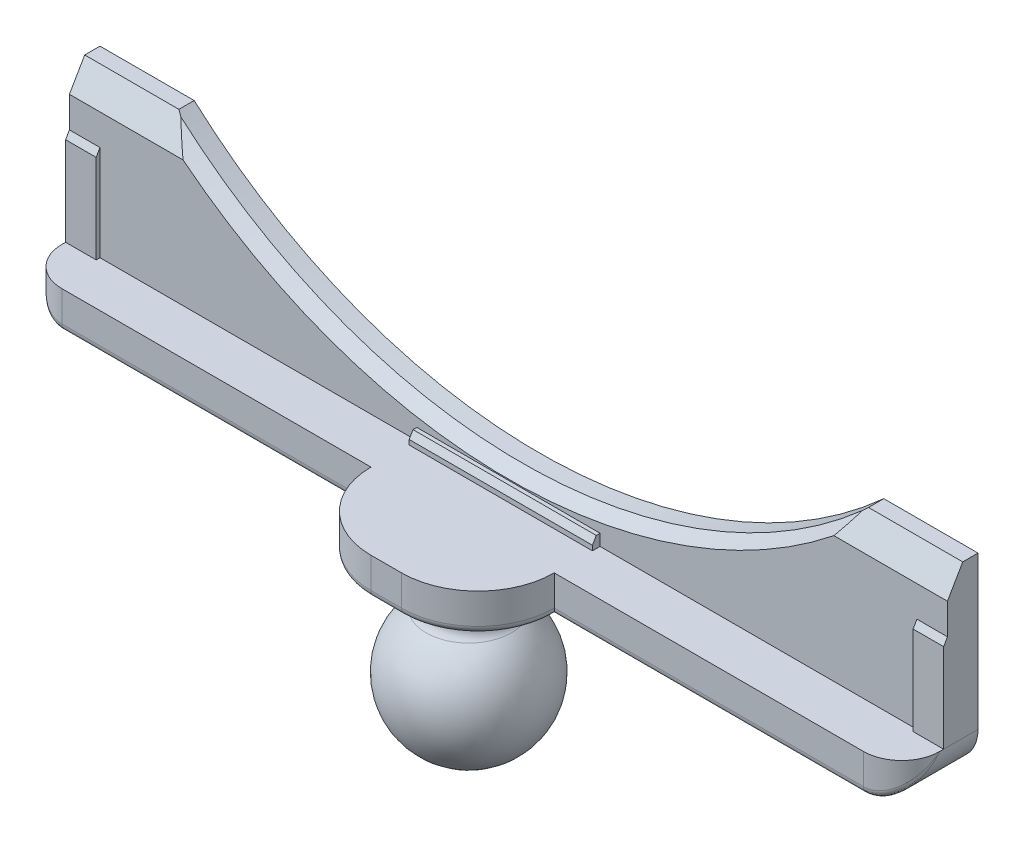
ISO-10303-21;
HEADER;
FILE_DESCRIPTION(('STEP AP214'),'2;1');
FILE_NAME('part.step','',(''),(''),'','','');
FILE_SCHEMA(('AUTOMOTIVE_DESIGN { 1 0 10303 214 1 1 1 1 }'));
ENDSEC;
DATA;
#1=APPLICATION_CONTEXT('core data for automotive mechanical design processes');
#2=APPLICATION_PROTOCOL_DEFINITION('international standard','automotive_design',2000,#1);
#3=PRODUCT_CONTEXT('',#1,'mechanical');
#4=PRODUCT('Part','Part','',(#3));
#5=PRODUCT_RELATED_PRODUCT_CATEGORY('part','',(#4));
#6=PRODUCT_DEFINITION_FORMATION('','',#4);
#7=PRODUCT_DEFINITION_CONTEXT('part definition',#1,'design');
#8=PRODUCT_DEFINITION('design','',#6,#7);
#9=PRODUCT_DEFINITION_SHAPE('','',#8);
#10=(LENGTH_UNIT() NAMED_UNIT(*) SI_UNIT(.MILLI.,.METRE.));
#11=(NAMED_UNIT(*) PLANE_ANGLE_UNIT() SI_UNIT($,.RADIAN.));
#12=(NAMED_UNIT(*) SI_UNIT($,.STERADIAN.) SOLID_ANGLE_UNIT());
#13=UNCERTAINTY_MEASURE_WITH_UNIT(LENGTH_MEASURE(1.E-05),#10,'distance_accuracy_value','');
#14=(GEOMETRIC_REPRESENTATION_CONTEXT(3) GLOBAL_UNCERTAINTY_ASSIGNED_CONTEXT((#13)) GLOBAL_UNIT_ASSIGNED_CONTEXT((#10,
#11,#12)) REPRESENTATION_CONTEXT('',''));
#15=CARTESIAN_POINT('',(0.,0.,0.));
#16=DIRECTION('',(0.,0.,1.));
#17=DIRECTION('',(1.,0.,0.));
#18=AXIS2_PLACEMENT_3D('',#15,#16,#17);
#19=CARTESIAN_POINT('',(0.,0.,4.));
#20=DIRECTION('',(0.,0.,-1.));
#21=DIRECTION('',(-1.,0.,0.));
#22=AXIS2_PLACEMENT_3D('',#19,#20,#21);
#23=PLANE('',#22);
#24=DIRECTION('',(0.,-1.,0.));
#25=VECTOR('',#24,1.);
#26=CARTESIAN_POINT('',(45.5,5.,4.));
#27=LINE('',#26,#25);
#28=CARTESIAN_POINT('',(45.5,6.5,4.));
#29=VERTEX_POINT('',#28);
#30=CARTESIAN_POINT('',(45.5,5.,4.));
#31=VERTEX_POINT('',#30);
#32=EDGE_CURVE('E268',#29,#31,#27,.T.);
#33=ORIENTED_EDGE('',*,*,#32,.F.);
#34=DIRECTION('',(-1.,0.,0.));
#35=VECTOR('',#34,1.);
#36=CARTESIAN_POINT('',(45.5,6.5,4.));
#37=LINE('',#36,#35);
#38=CARTESIAN_POINT('',(69.5,6.5,4.));
#39=VERTEX_POINT('',#38);
#40=EDGE_CURVE('E273',#39,#29,#37,.T.);
#41=ORIENTED_EDGE('',*,*,#40,.F.);
#42=DIRECTION('',(0.,1.,0.));
#43=VECTOR('',#42,1.);
#44=CARTESIAN_POINT('',(69.5,5.,4.));
#45=LINE('',#44,#43);
#46=CARTESIAN_POINT('',(69.5,5.,4.));
#47=VERTEX_POINT('',#46);
#48=EDGE_CURVE('E271',#47,#39,#45,.T.);
#49=ORIENTED_EDGE('',*,*,#48,.F.);
#50=DIRECTION('',(-1.,0.,0.));
#51=VECTOR('',#50,1.);
#52=CARTESIAN_POINT('',(0.,5.,4.));
#53=LINE('',#52,#51);
#54=CARTESIAN_POINT('',(111.,5.,4.));
#55=VERTEX_POINT('',#54);
#56=EDGE_CURVE('E246',#55,#47,#53,.T.);
#57=ORIENTED_EDGE('',*,*,#56,.F.);
#58=DIRECTION('',(0.,-1.,0.));
#59=VECTOR('',#58,1.);
#60=CARTESIAN_POINT('',(111.,5.,4.));
#61=LINE('',#60,#59);
#62=CARTESIAN_POINT('',(111.,17.5,4.));
#63=VERTEX_POINT('',#62);
#64=EDGE_CURVE('E283',#63,#55,#61,.T.);
#65=ORIENTED_EDGE('',*,*,#64,.F.);
#66=DIRECTION('',(-1.,0.,0.));
#67=VECTOR('',#66,1.);
#68=CARTESIAN_POINT('',(115.,17.5,4.));
#69=LINE('',#68,#67);
#70=CARTESIAN_POINT('',(115.,17.5,4.));
#71=VERTEX_POINT('',#70);
#72=EDGE_CURVE('E278',#71,#63,#69,.T.);
#73=ORIENTED_EDGE('',*,*,#72,.F.);
#74=DIRECTION('',(0.,1.,0.));
#75=VECTOR('',#74,1.);
#76=CARTESIAN_POINT('',(115.,0.,4.));
#77=LINE('',#76,#75);
#78=CARTESIAN_POINT('',(115.,21.5358983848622,4.));
#79=VERTEX_POINT('',#78);
#80=EDGE_CURVE('E342',#71,#79,#77,.T.);
#81=ORIENTED_EDGE('',*,*,#80,.T.);
#82=DIRECTION('',(-1.,0.,0.));
#83=VECTOR('',#82,1.);
#84=CARTESIAN_POINT('',(0.,21.5358983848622,4.));
#85=LINE('',#84,#83);
#86=CARTESIAN_POINT('',(100.125075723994,21.5358983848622,4.));
#87=VERTEX_POINT('',#86);
#88=EDGE_CURVE('E378',#79,#87,#85,.T.);
#89=ORIENTED_EDGE('',*,*,#88,.T.);
#90=CARTESIAN_POINT('',(57.5,75.0000454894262,4.));
#91=DIRECTION('',(0.,0.,-1.));
#92=DIRECTION('',(-1.,0.,0.));
#93=AXIS2_PLACEMENT_3D('',#90,#91,#92);
#94=CIRCLE('',#93,68.3762539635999);
#95=CARTESIAN_POINT('',(14.8749242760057,21.5358983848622,4.));
#96=VERTEX_POINT('',#95);
#97=EDGE_CURVE('E399',#87,#96,#94,.T.);
#98=ORIENTED_EDGE('',*,*,#97,.T.);
#99=CARTESIAN_POINT('',(0.,21.5358983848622,4.));
#100=VERTEX_POINT('',#99);
#101=EDGE_CURVE('E377',#96,#100,#85,.T.);
#102=ORIENTED_EDGE('',*,*,#101,.T.);
#103=DIRECTION('',(0.,-1.,0.));
#104=VECTOR('',#103,1.);
#105=CARTESIAN_POINT('',(0.,0.,4.));
#106=LINE('',#105,#104);
#107=CARTESIAN_POINT('',(0.,17.5,4.));
#108=VERTEX_POINT('',#107);
#109=EDGE_CURVE('E339',#100,#108,#106,.T.);
#110=ORIENTED_EDGE('',*,*,#109,.T.);
#111=DIRECTION('',(-1.,0.,0.));
#112=VECTOR('',#111,1.);
#113=CARTESIAN_POINT('',(0.,17.5,4.));
#114=LINE('',#113,#112);
#115=CARTESIAN_POINT('',(4.,17.5,4.));
#116=VERTEX_POINT('',#115);
#117=EDGE_CURVE('E298',#116,#108,#114,.T.);
#118=ORIENTED_EDGE('',*,*,#117,.F.);
#119=DIRECTION('',(0.,1.,0.));
#120=VECTOR('',#119,1.);
#121=CARTESIAN_POINT('',(4.,5.,4.));
#122=LINE('',#121,#120);
#123=CARTESIAN_POINT('',(4.,5.,4.));
#124=VERTEX_POINT('',#123);
#125=EDGE_CURVE('E294',#124,#116,#122,.T.);
#126=ORIENTED_EDGE('',*,*,#125,.F.);
#127=EDGE_CURVE('E322',#31,#124,#53,.T.);
#128=ORIENTED_EDGE('',*,*,#127,.F.);
#129=EDGE_LOOP('',(#33,#41,#49,#57,#65,#73,#81,#89,#98,#102,#110,#118,#126,#128));
#130=FACE_BOUND('',#129,.T.);
#131=ADVANCED_FACE('F37',(#130),#23,.F.);
#132=CARTESIAN_POINT('',(0.,5.,10.));
#133=DIRECTION('',(0.,-1.,0.));
#134=DIRECTION('',(0.,0.,-1.));
#135=AXIS2_PLACEMENT_3D('',#132,#133,#134);
#136=PLANE('',#135);
#137=DIRECTION('',(0.,0.,-1.));
#138=VECTOR('',#137,1.);
#139=CARTESIAN_POINT('',(45.5,5.,5.));
#140=LINE('',#139,#138);
#141=CARTESIAN_POINT('',(45.5,5.,5.));
#142=VERTEX_POINT('',#141);
#143=EDGE_CURVE('E250',#142,#31,#140,.T.);
#144=ORIENTED_EDGE('',*,*,#143,.T.);
#145=ORIENTED_EDGE('',*,*,#127,.T.);
#146=DIRECTION('',(0.,0.,-1.));
#147=VECTOR('',#146,1.);
#148=CARTESIAN_POINT('',(4.,5.,4.5));
#149=LINE('',#148,#147);
#150=CARTESIAN_POINT('',(4.,5.,4.5));
#151=VERTEX_POINT('',#150);
#152=EDGE_CURVE('E303',#151,#124,#149,.T.);
#153=ORIENTED_EDGE('',*,*,#152,.F.);
#154=DIRECTION('',(1.,0.,0.));
#155=VECTOR('',#154,1.);
#156=CARTESIAN_POINT('',(0.,5.,4.5));
#157=LINE('',#156,#155);
#158=CARTESIAN_POINT('',(0.,5.,4.5));
#159=VERTEX_POINT('',#158);
#160=EDGE_CURVE('E297',#159,#151,#157,.T.);
#161=ORIENTED_EDGE('',*,*,#160,.F.);
#162=DIRECTION('',(0.,0.,-1.));
#163=VECTOR('',#162,1.);
#164=CARTESIAN_POINT('',(0.,5.,10.));
#165=LINE('',#164,#163);
#166=CARTESIAN_POINT('',(0.,5.,5.));
#167=VERTEX_POINT('',#166);
#168=EDGE_CURVE('E330',#167,#159,#165,.T.);
#169=ORIENTED_EDGE('',*,*,#168,.F.);
#170=CARTESIAN_POINT('',(5.,5.,5.));
#171=DIRECTION('',(0.,-1.,0.));
#172=DIRECTION('',(0.,0.,-1.));
#173=AXIS2_PLACEMENT_3D('',#170,#171,#172);
#174=CIRCLE('',#173,5.);
#175=CARTESIAN_POINT('',(5.,5.,10.));
#176=VERTEX_POINT('',#175);
#177=EDGE_CURVE('E670',#167,#176,#174,.F.);
#178=ORIENTED_EDGE('',*,*,#177,.T.);
#179=DIRECTION('',(-1.,0.,0.));
#180=VECTOR('',#179,1.);
#181=CARTESIAN_POINT('',(0.,5.,10.));
#182=LINE('',#181,#180);
#183=CARTESIAN_POINT('',(45.5,5.,10.));
#184=VERTEX_POINT('',#183);
#185=EDGE_CURVE('E331',#184,#176,#182,.T.);
#186=ORIENTED_EDGE('',*,*,#185,.F.);
#187=CARTESIAN_POINT('',(55.5,5.,10.));
#188=DIRECTION('',(0.,-1.,0.));
#189=DIRECTION('',(0.,0.,-1.));
#190=AXIS2_PLACEMENT_3D('',#187,#188,#189);
#191=CIRCLE('',#190,10.);
#192=CARTESIAN_POINT('',(55.5,5.,20.));
#193=VERTEX_POINT('',#192);
#194=EDGE_CURVE('E369',#184,#193,#191,.F.);
#195=ORIENTED_EDGE('',*,*,#194,.T.);
#196=DIRECTION('',(-1.,0.,0.));
#197=VECTOR('',#196,1.);
#198=CARTESIAN_POINT('',(45.5,5.,20.));
#199=LINE('',#198,#197);
#200=CARTESIAN_POINT('',(59.5,5.,20.));
#201=VERTEX_POINT('',#200);
#202=EDGE_CURVE('E320',#201,#193,#199,.T.);
#203=ORIENTED_EDGE('',*,*,#202,.F.);
#204=CARTESIAN_POINT('',(59.5,5.,10.));
#205=DIRECTION('',(0.,-1.,0.));
#206=DIRECTION('',(0.,0.,-1.));
#207=AXIS2_PLACEMENT_3D('',#204,#205,#206);
#208=CIRCLE('',#207,10.);
#209=CARTESIAN_POINT('',(69.5,5.,10.));
#210=VERTEX_POINT('',#209);
#211=EDGE_CURVE('E374',#201,#210,#208,.F.);
#212=ORIENTED_EDGE('',*,*,#211,.T.);
#213=CARTESIAN_POINT('',(110.,5.,10.));
#214=VERTEX_POINT('',#213);
#215=EDGE_CURVE('E328',#214,#210,#182,.T.);
#216=ORIENTED_EDGE('',*,*,#215,.F.);
#217=CARTESIAN_POINT('',(110.,5.,5.));
#218=DIRECTION('',(0.,-1.,0.));
#219=DIRECTION('',(0.,0.,-1.));
#220=AXIS2_PLACEMENT_3D('',#217,#218,#219);
#221=CIRCLE('',#220,5.);
#222=CARTESIAN_POINT('',(115.,5.,5.));
#223=VERTEX_POINT('',#222);
#224=EDGE_CURVE('E571',#214,#223,#221,.F.);
#225=ORIENTED_EDGE('',*,*,#224,.T.);
#226=DIRECTION('',(0.,0.,-1.));
#227=VECTOR('',#226,1.);
#228=CARTESIAN_POINT('',(115.,5.,10.));
#229=LINE('',#228,#227);
#230=CARTESIAN_POINT('',(115.,5.,4.5));
#231=VERTEX_POINT('',#230);
#232=EDGE_CURVE('E335',#223,#231,#229,.T.);
#233=ORIENTED_EDGE('',*,*,#232,.T.);
#234=DIRECTION('',(1.,0.,0.));
#235=VECTOR('',#234,1.);
#236=CARTESIAN_POINT('',(115.,5.,4.5));
#237=LINE('',#236,#235);
#238=CARTESIAN_POINT('',(111.,5.,4.5));
#239=VERTEX_POINT('',#238);
#240=EDGE_CURVE('E285',#239,#231,#237,.T.);
#241=ORIENTED_EDGE('',*,*,#240,.F.);
#242=DIRECTION('',(0.,0.,-1.));
#243=VECTOR('',#242,1.);
#244=CARTESIAN_POINT('',(111.,5.,4.5));
#245=LINE('',#244,#243);
#246=EDGE_CURVE('E288',#239,#55,#245,.T.);
#247=ORIENTED_EDGE('',*,*,#246,.T.);
#248=ORIENTED_EDGE('',*,*,#56,.T.);
#249=DIRECTION('',(0.,0.,-1.));
#250=VECTOR('',#249,1.);
#251=CARTESIAN_POINT('',(69.5,5.,5.));
#252=LINE('',#251,#250);
#253=CARTESIAN_POINT('',(69.5,5.,5.));
#254=VERTEX_POINT('',#253);
#255=EDGE_CURVE('E240',#254,#47,#252,.T.);
#256=ORIENTED_EDGE('',*,*,#255,.F.);
#257=DIRECTION('',(1.,0.,0.));
#258=VECTOR('',#257,1.);
#259=CARTESIAN_POINT('',(45.5,5.,5.));
#260=LINE('',#259,#258);
#261=EDGE_CURVE('E243',#142,#254,#260,.T.);
#262=ORIENTED_EDGE('',*,*,#261,.F.);
#263=EDGE_LOOP('',(#144,#145,#153,#161,#169,#178,#186,#195,#203,#212,#216,#225,#233,#241,#247,
#248,#256,#262));
#264=FACE_BOUND('',#263,.T.);
#265=ADVANCED_FACE('F242',(#264),#136,.F.);
#266=CARTESIAN_POINT('',(0.,25.,4.));
#267=DIRECTION('',(0.,-1.,0.));
#268=DIRECTION('',(0.,0.,-1.));
#269=AXIS2_PLACEMENT_3D('',#266,#267,#268);
#270=PLANE('',#269);
#271=DIRECTION('',(-1.,0.,0.));
#272=VECTOR('',#271,1.);
#273=CARTESIAN_POINT('',(0.,25.,0.));
#274=LINE('',#273,#272);
#275=CARTESIAN_POINT('',(115.,25.,0.));
#276=VERTEX_POINT('',#275);
#277=CARTESIAN_POINT('',(102.661433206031,25.,0.));
#278=VERTEX_POINT('',#277);
#279=EDGE_CURVE('E343',#276,#278,#274,.T.);
#280=ORIENTED_EDGE('',*,*,#279,.T.);
#281=DIRECTION('',(0.,0.,1.));
#282=VECTOR('',#281,1.);
#283=CARTESIAN_POINT('',(102.661433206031,25.,-6.));
#284=LINE('',#283,#282);
#285=CARTESIAN_POINT('',(102.661433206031,25.,2.));
#286=VERTEX_POINT('',#285);
#287=EDGE_CURVE('E316',#278,#286,#284,.T.);
#288=ORIENTED_EDGE('',*,*,#287,.T.);
#289=DIRECTION('',(1.,0.,0.));
#290=VECTOR('',#289,1.);
#291=CARTESIAN_POINT('',(0.,25.,2.));
#292=LINE('',#291,#290);
#293=CARTESIAN_POINT('',(115.,25.,2.));
#294=VERTEX_POINT('',#293);
#295=EDGE_CURVE('E383',#286,#294,#292,.T.);
#296=ORIENTED_EDGE('',*,*,#295,.T.);
#297=DIRECTION('',(0.,0.,-1.));
#298=VECTOR('',#297,1.);
#299=CARTESIAN_POINT('',(115.,25.,4.));
#300=LINE('',#299,#298);
#301=EDGE_CURVE('E357',#294,#276,#300,.T.);
#302=ORIENTED_EDGE('',*,*,#301,.T.);
#303=EDGE_LOOP('',(#280,#288,#296,#302));
#304=FACE_BOUND('',#303,.T.);
#305=ADVANCED_FACE('F472',(#304),#270,.F.);
#306=CARTESIAN_POINT('',(0.,21.5358983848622,4.));
#307=DIRECTION('',(0.,-0.5,-0.866025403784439));
#308=DIRECTION('',(-1.,0.,0.));
#309=AXIS2_PLACEMENT_3D('',#306,#307,#308);
#310=PLANE('',#309);
#311=CARTESIAN_POINT('',(57.5,75.0000454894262,-26.8675397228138));
#312=DIRECTION('',(0.,-0.5,-0.866025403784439));
#313=DIRECTION('',(0.,-0.866025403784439,0.5));
#314=AXIS2_PLACEMENT_3D('',#311,#312,#313);
#315=ELLIPSE('',#314,77.799396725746,67.3762539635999);
#316=CARTESIAN_POINT('',(102.142238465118,24.5358983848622,2.26794919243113));
#317=VERTEX_POINT('',#316);
#318=EDGE_CURVE('E393',#317,#286,#315,.F.);
#319=ORIENTED_EDGE('',*,*,#318,.F.);
#320=CARTESIAN_POINT('',(57.5,56.041968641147,-15.9220889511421));
#321=DIRECTION('',(0.,-0.5,-0.866025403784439));
#322=DIRECTION('',(0.,-0.866025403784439,0.5));
#323=AXIS2_PLACEMENT_3D('',#320,#321,#322);
#324=ELLIPSE('',#323,65.6727046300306,53.6215387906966);
#325=EDGE_CURVE('E397',#317,#87,#324,.T.);
#326=ORIENTED_EDGE('',*,*,#325,.T.);
#327=ORIENTED_EDGE('',*,*,#88,.F.);
#328=DIRECTION('',(0.,0.866025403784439,-0.5));
#329=VECTOR('',#328,1.);
#330=CARTESIAN_POINT('',(115.,21.5358983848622,4.));
#331=LINE('',#330,#329);
#332=EDGE_CURVE('E387',#294,#79,#331,.F.);
#333=ORIENTED_EDGE('',*,*,#332,.F.);
#334=ORIENTED_EDGE('',*,*,#295,.F.);
#335=EDGE_LOOP('',(#319,#326,#327,#333,#334));
#336=FACE_BOUND('',#335,.T.);
#337=ADVANCED_FACE('F522',(#336),#310,.F.);
#338=CARTESIAN_POINT('',(0.,0.,10.));
#339=DIRECTION('',(0.,0.,-1.));
#340=DIRECTION('',(-1.,0.,0.));
#341=AXIS2_PLACEMENT_3D('',#338,#339,#340);
#342=PLANE('',#341);
#343=ORIENTED_EDGE('',*,*,#185,.T.);
#344=DIRECTION('',(0.,-1.,0.));
#345=VECTOR('',#344,1.);
#346=CARTESIAN_POINT('',(5.,0.,10.));
#347=LINE('',#346,#345);
#348=CARTESIAN_POINT('',(5.,1.,10.));
#349=VERTEX_POINT('',#348);
#350=EDGE_CURVE('E576',#176,#349,#347,.T.);
#351=ORIENTED_EDGE('',*,*,#350,.T.);
#352=DIRECTION('',(1.,0.,0.));
#353=VECTOR('',#352,1.);
#354=CARTESIAN_POINT('',(0.,1.,10.));
#355=LINE('',#354,#353);
#356=CARTESIAN_POINT('',(45.5,1.,10.));
#357=VERTEX_POINT('',#356);
#358=EDGE_CURVE('E408',#349,#357,#355,.T.);
#359=ORIENTED_EDGE('',*,*,#358,.T.);
#360=DIRECTION('',(0.,-1.,0.));
#361=VECTOR('',#360,1.);
#362=CARTESIAN_POINT('',(45.5,0.,10.));
#363=LINE('',#362,#361);
#364=EDGE_CURVE('E319',#184,#357,#363,.T.);
#365=ORIENTED_EDGE('',*,*,#364,.F.);
#366=EDGE_LOOP('',(#343,#351,#359,#365));
#367=FACE_BOUND('',#366,.T.);
#368=ADVANCED_FACE('F530',(#367),#342,.F.);
#369=DIRECTION('',(1.,0.,0.));
#370=VECTOR('',#369,1.);
#371=CARTESIAN_POINT('',(0.,1.,10.));
#372=LINE('',#371,#370);
#373=CARTESIAN_POINT('',(69.5,1.,10.));
#374=VERTEX_POINT('',#373);
#375=CARTESIAN_POINT('',(110.,1.,10.));
#376=VERTEX_POINT('',#375);
#377=EDGE_CURVE('E403',#374,#376,#372,.T.);
#378=ORIENTED_EDGE('',*,*,#377,.T.);
#379=DIRECTION('',(0.,1.,0.));
#380=VECTOR('',#379,1.);
#381=CARTESIAN_POINT('',(110.,0.,10.));
#382=LINE('',#381,#380);
#383=EDGE_CURVE('E688',#376,#214,#382,.T.);
#384=ORIENTED_EDGE('',*,*,#383,.T.);
#385=ORIENTED_EDGE('',*,*,#215,.T.);
#386=DIRECTION('',(0.,1.,0.));
#387=VECTOR('',#386,1.);
#388=CARTESIAN_POINT('',(69.5,0.,10.));
#389=LINE('',#388,#387);
#390=EDGE_CURVE('E323',#374,#210,#389,.T.);
#391=ORIENTED_EDGE('',*,*,#390,.F.);
#392=EDGE_LOOP('',(#378,#384,#385,#391));
#393=FACE_BOUND('',#392,.T.);
#394=ADVANCED_FACE('F497',(#393),#342,.F.);
#395=CARTESIAN_POINT('',(0.,0.,4.));
#396=DIRECTION('',(1.,0.,0.));
#397=DIRECTION('',(0.,0.,-1.));
#398=AXIS2_PLACEMENT_3D('',#395,#396,#397);
#399=PLANE('',#398);
#400=DIRECTION('',(0.,-1.,0.));
#401=VECTOR('',#400,1.);
#402=CARTESIAN_POINT('',(0.,5.,4.5));
#403=LINE('',#402,#401);
#404=CARTESIAN_POINT('',(0.,16.6339745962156,4.5));
#405=VERTEX_POINT('',#404);
#406=EDGE_CURVE('E295',#405,#159,#403,.T.);
#407=ORIENTED_EDGE('',*,*,#406,.F.);
#408=DIRECTION('',(0.,-0.866025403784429,0.500000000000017));
#409=VECTOR('',#408,1.);
#410=CARTESIAN_POINT('',(0.,16.6339745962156,4.5));
#411=LINE('',#410,#409);
#412=EDGE_CURVE('E632',#405,#108,#411,.F.);
#413=ORIENTED_EDGE('',*,*,#412,.T.);
#414=ORIENTED_EDGE('',*,*,#109,.F.);
#415=DIRECTION('',(0.,-0.866025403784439,0.5));
#416=VECTOR('',#415,1.);
#417=CARTESIAN_POINT('',(0.,21.5358983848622,4.));
#418=LINE('',#417,#416);
#419=CARTESIAN_POINT('',(0.,25.,2.));
#420=VERTEX_POINT('',#419);
#421=EDGE_CURVE('E381',#100,#420,#418,.F.);
#422=ORIENTED_EDGE('',*,*,#421,.T.);
#423=DIRECTION('',(0.,0.,-1.));
#424=VECTOR('',#423,1.);
#425=CARTESIAN_POINT('',(0.,25.,4.));
#426=LINE('',#425,#424);
#427=CARTESIAN_POINT('',(0.,25.,0.));
#428=VERTEX_POINT('',#427);
#429=EDGE_CURVE('E345',#420,#428,#426,.T.);
#430=ORIENTED_EDGE('',*,*,#429,.T.);
#431=DIRECTION('',(0.,-1.,0.));
#432=VECTOR('',#431,1.);
#433=CARTESIAN_POINT('',(0.,0.,0.));
#434=LINE('',#433,#432);
#435=CARTESIAN_POINT('',(0.,5.,0.));
#436=VERTEX_POINT('',#435);
#437=EDGE_CURVE('E338',#428,#436,#434,.T.);
#438=ORIENTED_EDGE('',*,*,#437,.T.);
#439=DIRECTION('',(0.,0.,-1.));
#440=VECTOR('',#439,1.);
#441=CARTESIAN_POINT('',(0.,5.,4.));
#442=LINE('',#441,#440);
#443=EDGE_CURVE('E626',#436,#159,#442,.F.);
#444=ORIENTED_EDGE('',*,*,#443,.T.);
#445=EDGE_LOOP('',(#407,#413,#414,#422,#430,#438,#444));
#446=FACE_BOUND('',#445,.T.);
#447=ADVANCED_FACE('F493',(#446),#399,.F.);
#448=CARTESIAN_POINT('',(0.,0.,4.));
#449=DIRECTION('',(0.,1.,0.));
#450=DIRECTION('',(0.,0.,1.));
#451=AXIS2_PLACEMENT_3D('',#448,#449,#450);
#452=PLANE('',#451);
#453=CARTESIAN_POINT('',(57.5,0.,9.2));
#454=DIRECTION('',(0.,1.,0.));
#455=DIRECTION('',(0.,0.,1.));
#456=AXIS2_PLACEMENT_3D('',#453,#454,#455);
#457=CIRCLE('',#456,7.);
#458=CARTESIAN_POINT('',(57.5,0.,16.2));
#459=VERTEX_POINT('',#458);
#460=EDGE_CURVE('E625',#459,#459,#457,.T.);
#461=ORIENTED_EDGE('',*,*,#460,.T.);
#462=EDGE_LOOP('',(#461));
#463=FACE_BOUND('',#462,.T.);
#464=DIRECTION('',(1.,0.,0.));
#465=VECTOR('',#464,1.);
#466=CARTESIAN_POINT('',(0.,0.,9.));
#467=LINE('',#466,#465);
#468=CARTESIAN_POINT('',(46.5557280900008,0.,9.));
#469=VERTEX_POINT('',#468);
#470=CARTESIAN_POINT('',(5.,0.,9.));
#471=VERTEX_POINT('',#470);
#472=EDGE_CURVE('E410',#469,#471,#467,.F.);
#473=ORIENTED_EDGE('',*,*,#472,.T.);
#474=DIRECTION('',(0.,0.,-1.));
#475=VECTOR('',#474,1.);
#476=CARTESIAN_POINT('',(5.,0.,4.));
#477=LINE('',#476,#475);
#478=CARTESIAN_POINT('',(5.,0.,0.));
#479=VERTEX_POINT('',#478);
#480=EDGE_CURVE('E666',#471,#479,#477,.T.);
#481=ORIENTED_EDGE('',*,*,#480,.T.);
#482=DIRECTION('',(1.,0.,0.));
#483=VECTOR('',#482,1.);
#484=CARTESIAN_POINT('',(0.,0.,0.));
#485=LINE('',#484,#483);
#486=CARTESIAN_POINT('',(110.,0.,0.));
#487=VERTEX_POINT('',#486);
#488=EDGE_CURVE('E348',#479,#487,#485,.T.);
#489=ORIENTED_EDGE('',*,*,#488,.T.);
#490=DIRECTION('',(0.,0.,-1.));
#491=VECTOR('',#490,1.);
#492=CARTESIAN_POINT('',(110.,0.,4.));
#493=LINE('',#492,#491);
#494=CARTESIAN_POINT('',(110.,0.,9.));
#495=VERTEX_POINT('',#494);
#496=EDGE_CURVE('E569',#487,#495,#493,.F.);
#497=ORIENTED_EDGE('',*,*,#496,.T.);
#498=DIRECTION('',(1.,0.,0.));
#499=VECTOR('',#498,1.);
#500=CARTESIAN_POINT('',(0.,0.,9.));
#501=LINE('',#500,#499);
#502=CARTESIAN_POINT('',(68.4442719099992,0.,9.));
#503=VERTEX_POINT('',#502);
#504=EDGE_CURVE('E406',#495,#503,#501,.F.);
#505=ORIENTED_EDGE('',*,*,#504,.T.);
#506=CARTESIAN_POINT('',(59.5,0.,10.));
#507=DIRECTION('',(0.,1.,0.));
#508=DIRECTION('',(0.,0.,1.));
#509=AXIS2_PLACEMENT_3D('',#506,#507,#508);
#510=CIRCLE('',#509,9.);
#511=CARTESIAN_POINT('',(59.5,0.,19.));
#512=VERTEX_POINT('',#511);
#513=EDGE_CURVE('E418',#503,#512,#510,.F.);
#514=ORIENTED_EDGE('',*,*,#513,.T.);
#515=DIRECTION('',(1.,0.,0.));
#516=VECTOR('',#515,1.);
#517=CARTESIAN_POINT('',(0.,0.,19.));
#518=LINE('',#517,#516);
#519=CARTESIAN_POINT('',(55.5,0.,19.));
#520=VERTEX_POINT('',#519);
#521=EDGE_CURVE('E416',#512,#520,#518,.F.);
#522=ORIENTED_EDGE('',*,*,#521,.T.);
#523=CARTESIAN_POINT('',(55.5,0.,10.));
#524=DIRECTION('',(0.,1.,0.));
#525=DIRECTION('',(0.,0.,1.));
#526=AXIS2_PLACEMENT_3D('',#523,#524,#525);
#527=CIRCLE('',#526,9.);
#528=EDGE_CURVE('E413',#520,#469,#527,.F.);
#529=ORIENTED_EDGE('',*,*,#528,.T.);
#530=EDGE_LOOP('',(#473,#481,#489,#497,#505,#514,#522,#529));
#531=FACE_BOUND('',#530,.T.);
#532=ADVANCED_FACE('F489',(#463,#531),#452,.F.);
#533=CARTESIAN_POINT('',(115.,0.,4.));
#534=DIRECTION('',(-1.,0.,0.));
#535=DIRECTION('',(0.,0.,1.));
#536=AXIS2_PLACEMENT_3D('',#533,#534,#535);
#537=PLANE('',#536);
#538=ORIENTED_EDGE('',*,*,#80,.F.);
#539=DIRECTION('',(0.,-0.866025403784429,0.500000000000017));
#540=VECTOR('',#539,1.);
#541=CARTESIAN_POINT('',(115.,16.6339745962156,4.5));
#542=LINE('',#541,#540);
#543=CARTESIAN_POINT('',(115.,16.6339745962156,4.5));
#544=VERTEX_POINT('',#543);
#545=EDGE_CURVE('E641',#71,#544,#542,.T.);
#546=ORIENTED_EDGE('',*,*,#545,.T.);
#547=DIRECTION('',(0.,1.,0.));
#548=VECTOR('',#547,1.);
#549=CARTESIAN_POINT('',(115.,5.,4.5));
#550=LINE('',#549,#548);
#551=EDGE_CURVE('E279',#231,#544,#550,.T.);
#552=ORIENTED_EDGE('',*,*,#551,.F.);
#553=DIRECTION('',(0.,0.,-1.));
#554=VECTOR('',#553,1.);
#555=CARTESIAN_POINT('',(115.,5.,4.));
#556=LINE('',#555,#554);
#557=CARTESIAN_POINT('',(115.,5.,0.));
#558=VERTEX_POINT('',#557);
#559=EDGE_CURVE('E563',#231,#558,#556,.T.);
#560=ORIENTED_EDGE('',*,*,#559,.T.);
#561=DIRECTION('',(0.,1.,0.));
#562=VECTOR('',#561,1.);
#563=CARTESIAN_POINT('',(115.,0.,0.));
#564=LINE('',#563,#562);
#565=EDGE_CURVE('E350',#558,#276,#564,.T.);
#566=ORIENTED_EDGE('',*,*,#565,.T.);
#567=ORIENTED_EDGE('',*,*,#301,.F.);
#568=ORIENTED_EDGE('',*,*,#332,.T.);
#569=EDGE_LOOP('',(#538,#546,#552,#560,#566,#567,#568));
#570=FACE_BOUND('',#569,.T.);
#571=ADVANCED_FACE('F485',(#570),#537,.F.);
#572=CARTESIAN_POINT('',(12.3385667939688,25.,2.));
#573=VERTEX_POINT('',#572);
#574=EDGE_CURVE('E384',#420,#573,#292,.T.);
#575=ORIENTED_EDGE('',*,*,#574,.T.);
#576=DIRECTION('',(0.,0.,1.));
#577=VECTOR('',#576,1.);
#578=CARTESIAN_POINT('',(12.3385667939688,25.,-6.));
#579=LINE('',#578,#577);
#580=CARTESIAN_POINT('',(12.3385667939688,25.,0.));
#581=VERTEX_POINT('',#580);
#582=EDGE_CURVE('E310',#573,#581,#579,.F.);
#583=ORIENTED_EDGE('',*,*,#582,.T.);
#584=EDGE_CURVE('E352',#581,#428,#274,.T.);
#585=ORIENTED_EDGE('',*,*,#584,.T.);
#586=ORIENTED_EDGE('',*,*,#429,.F.);
#587=EDGE_LOOP('',(#575,#583,#585,#586));
#588=FACE_BOUND('',#587,.T.);
#589=ADVANCED_FACE('F481',(#588),#270,.F.);
#590=CARTESIAN_POINT('',(0.,0.,0.));
#591=DIRECTION('',(0.,0.,-1.));
#592=DIRECTION('',(-1.,0.,0.));
#593=AXIS2_PLACEMENT_3D('',#590,#591,#592);
#594=PLANE('',#593);
#595=ORIENTED_EDGE('',*,*,#488,.F.);
#596=CARTESIAN_POINT('',(5.,5.,0.));
#597=DIRECTION('',(0.,0.,-1.));
#598=DIRECTION('',(-1.,0.,0.));
#599=AXIS2_PLACEMENT_3D('',#596,#597,#598);
#600=CIRCLE('',#599,5.);
#601=EDGE_CURVE('E677',#479,#436,#600,.T.);
#602=ORIENTED_EDGE('',*,*,#601,.T.);
#603=ORIENTED_EDGE('',*,*,#437,.F.);
#604=ORIENTED_EDGE('',*,*,#584,.F.);
#605=CARTESIAN_POINT('',(57.5,75.0000454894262,0.));
#606=DIRECTION('',(0.,0.,-1.));
#607=DIRECTION('',(-1.,0.,0.));
#608=AXIS2_PLACEMENT_3D('',#605,#606,#607);
#609=CIRCLE('',#608,67.3762539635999);
#610=EDGE_CURVE('E313',#278,#581,#609,.T.);
#611=ORIENTED_EDGE('',*,*,#610,.F.);
#612=ORIENTED_EDGE('',*,*,#279,.F.);
#613=ORIENTED_EDGE('',*,*,#565,.F.);
#614=CARTESIAN_POINT('',(110.,5.,0.));
#615=DIRECTION('',(0.,0.,-1.));
#616=DIRECTION('',(-1.,0.,0.));
#617=AXIS2_PLACEMENT_3D('',#614,#615,#616);
#618=CIRCLE('',#617,5.);
#619=EDGE_CURVE('E566',#558,#487,#618,.T.);
#620=ORIENTED_EDGE('',*,*,#619,.T.);
#621=EDGE_LOOP('',(#595,#602,#603,#604,#611,#612,#613,#620));
#622=FACE_BOUND('',#621,.T.);
#623=ADVANCED_FACE('F477',(#622),#594,.T.);
#624=CARTESIAN_POINT('',(57.5,-5.,9.2));
#625=DIRECTION('',(0.,1.,0.));
#626=DIRECTION('',(0.,0.,1.));
#627=AXIS2_PLACEMENT_3D('',#624,#625,#626);
#628=CYLINDRICAL_SURFACE('',#627,5.);
#629=CARTESIAN_POINT('',(57.5,-2.,9.2));
#630=DIRECTION('',(0.,1.,0.));
#631=DIRECTION('',(0.,0.,1.));
#632=AXIS2_PLACEMENT_3D('',#629,#630,#631);
#633=CIRCLE('',#632,5.);
#634=CARTESIAN_POINT('',(57.5,-2.,14.2));
#635=VERTEX_POINT('',#634);
#636=EDGE_CURVE('E622',#635,#635,#633,.F.);
#637=ORIENTED_EDGE('',*,*,#636,.T.);
#638=EDGE_LOOP('',(#637));
#639=FACE_BOUND('',#638,.T.);
#640=CARTESIAN_POINT('',(57.5,-4.22865111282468,9.2));
#641=DIRECTION('',(0.,-1.,0.));
#642=DIRECTION('',(0.,0.,-1.));
#643=AXIS2_PLACEMENT_3D('',#640,#641,#642);
#644=CIRCLE('',#643,5.);
#645=CARTESIAN_POINT('',(57.5,-4.22865111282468,4.2));
#646=VERTEX_POINT('',#645);
#647=EDGE_CURVE('E363',#646,#646,#644,.F.);
#648=ORIENTED_EDGE('',*,*,#647,.T.);
#649=EDGE_LOOP('',(#648));
#650=FACE_BOUND('',#649,.T.);
#651=ADVANCED_FACE('F480',(#639,#650),#628,.T.);
#652=CARTESIAN_POINT('',(57.5,-12.6287313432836,9.2));
#653=DIRECTION('',(0.,0.,1.));
#654=DIRECTION('',(1.,0.,0.));
#655=AXIS2_PLACEMENT_3D('',#652,#653,#654);
#656=SPHERICAL_SURFACE('',#655,9.12126865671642);
#657=CARTESIAN_POINT('',(57.5,-12.6287313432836,9.2));
#658=DIRECTION('',(0.,-1.,0.));
#659=DIRECTION('',(0.,0.,-1.));
#660=AXIS2_PLACEMENT_3D('',#657,#658,#659);
#661=SPHERICAL_SURFACE('',#660,9.12126865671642);
#662=CARTESIAN_POINT('',(57.5,-5.41496140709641,9.2));
#663=DIRECTION('',(0.,-1.,0.));
#664=DIRECTION('',(0.,0.,-1.));
#665=AXIS2_PLACEMENT_3D('',#662,#663,#664);
#666=CIRCLE('',#665,5.58203056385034);
#667=CARTESIAN_POINT('',(57.5,-5.41496140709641,3.61796943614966));
#668=VERTEX_POINT('',#667);
#669=EDGE_CURVE('E360',#668,#668,#666,.T.);
#670=ORIENTED_EDGE('',*,*,#669,.T.);
#671=EDGE_LOOP('',(#670));
#672=FACE_BOUND('',#671,.T.);
#673=ADVANCED_FACE('F499',(#672),#661,.T.);
#674=CARTESIAN_POINT('',(57.5,-4.22865111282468,9.2));
#675=DIRECTION('',(0.,-1.,0.));
#676=DIRECTION('',(0.,0.,-1.));
#677=AXIS2_PLACEMENT_3D('',#674,#675,#676);
#678=TOROIDAL_SURFACE('',#677,6.5,1.5);
#679=ORIENTED_EDGE('',*,*,#647,.F.);
#680=EDGE_LOOP('',(#679));
#681=FACE_BOUND('',#680,.T.);
#682=ORIENTED_EDGE('',*,*,#669,.F.);
#683=EDGE_LOOP('',(#682));
#684=FACE_BOUND('',#683,.T.);
#685=ADVANCED_FACE('F502',(#681,#684),#678,.F.);
#686=CARTESIAN_POINT('',(0.,0.,20.));
#687=DIRECTION('',(0.,0.,-1.));
#688=DIRECTION('',(-1.,0.,0.));
#689=AXIS2_PLACEMENT_3D('',#686,#687,#688);
#690=PLANE('',#689);
#691=DIRECTION('',(0.,-1.,0.));
#692=VECTOR('',#691,1.);
#693=CARTESIAN_POINT('',(55.5,0.,20.));
#694=LINE('',#693,#692);
#695=CARTESIAN_POINT('',(55.5,1.,20.));
#696=VERTEX_POINT('',#695);
#697=EDGE_CURVE('E366',#193,#696,#694,.T.);
#698=ORIENTED_EDGE('',*,*,#697,.T.);
#699=DIRECTION('',(1.,0.,0.));
#700=VECTOR('',#699,1.);
#701=CARTESIAN_POINT('',(0.,1.,20.));
#702=LINE('',#701,#700);
#703=CARTESIAN_POINT('',(59.5,1.,20.));
#704=VERTEX_POINT('',#703);
#705=EDGE_CURVE('E423',#696,#704,#702,.T.);
#706=ORIENTED_EDGE('',*,*,#705,.T.);
#707=DIRECTION('',(0.,1.,0.));
#708=VECTOR('',#707,1.);
#709=CARTESIAN_POINT('',(59.5,0.,20.));
#710=LINE('',#709,#708);
#711=EDGE_CURVE('E372',#704,#201,#710,.T.);
#712=ORIENTED_EDGE('',*,*,#711,.T.);
#713=ORIENTED_EDGE('',*,*,#202,.T.);
#714=EDGE_LOOP('',(#698,#706,#712,#713));
#715=FACE_BOUND('',#714,.T.);
#716=ADVANCED_FACE('F506',(#715),#690,.F.);
#717=CARTESIAN_POINT('',(55.5,0.,10.));
#718=DIRECTION('',(0.,-1.,0.));
#719=DIRECTION('',(0.,0.,-1.));
#720=AXIS2_PLACEMENT_3D('',#717,#718,#719);
#721=CYLINDRICAL_SURFACE('',#720,10.);
#722=ORIENTED_EDGE('',*,*,#364,.T.);
#723=CARTESIAN_POINT('',(55.5,1.,10.));
#724=DIRECTION('',(0.,1.,0.));
#725=DIRECTION('',(0.,0.,1.));
#726=AXIS2_PLACEMENT_3D('',#723,#724,#725);
#727=CIRCLE('',#726,10.);
#728=EDGE_CURVE('E425',#357,#696,#727,.T.);
#729=ORIENTED_EDGE('',*,*,#728,.T.);
#730=ORIENTED_EDGE('',*,*,#697,.F.);
#731=ORIENTED_EDGE('',*,*,#194,.F.);
#732=EDGE_LOOP('',(#722,#729,#730,#731));
#733=FACE_BOUND('',#732,.T.);
#734=ADVANCED_FACE('F508',(#733),#721,.T.);
#735=CARTESIAN_POINT('',(59.5,0.,10.));
#736=DIRECTION('',(0.,1.,0.));
#737=DIRECTION('',(0.,0.,1.));
#738=AXIS2_PLACEMENT_3D('',#735,#736,#737);
#739=CYLINDRICAL_SURFACE('',#738,10.);
#740=ORIENTED_EDGE('',*,*,#711,.F.);
#741=CARTESIAN_POINT('',(59.5,1.,10.));
#742=DIRECTION('',(0.,1.,0.));
#743=DIRECTION('',(0.,0.,1.));
#744=AXIS2_PLACEMENT_3D('',#741,#742,#743);
#745=CIRCLE('',#744,10.);
#746=EDGE_CURVE('E421',#704,#374,#745,.T.);
#747=ORIENTED_EDGE('',*,*,#746,.T.);
#748=ORIENTED_EDGE('',*,*,#390,.T.);
#749=ORIENTED_EDGE('',*,*,#211,.F.);
#750=EDGE_LOOP('',(#740,#747,#748,#749));
#751=FACE_BOUND('',#750,.T.);
#752=ADVANCED_FACE('F511',(#751),#739,.T.);
#753=ORIENTED_EDGE('',*,*,#101,.F.);
#754=CARTESIAN_POINT('',(57.5,56.041968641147,-15.9220889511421));
#755=DIRECTION('',(0.,-0.5,-0.866025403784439));
#756=DIRECTION('',(0.,-0.866025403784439,0.5));
#757=AXIS2_PLACEMENT_3D('',#754,#755,#756);
#758=ELLIPSE('',#757,65.6727046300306,53.6215387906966);
#759=CARTESIAN_POINT('',(12.8577615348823,24.5358983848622,2.26794919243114));
#760=VERTEX_POINT('',#759);
#761=EDGE_CURVE('E401',#96,#760,#758,.T.);
#762=ORIENTED_EDGE('',*,*,#761,.T.);
#763=EDGE_CURVE('E390',#573,#760,#315,.F.);
#764=ORIENTED_EDGE('',*,*,#763,.F.);
#765=ORIENTED_EDGE('',*,*,#574,.F.);
#766=ORIENTED_EDGE('',*,*,#421,.F.);
#767=EDGE_LOOP('',(#753,#762,#764,#765,#766));
#768=FACE_BOUND('',#767,.T.);
#769=ADVANCED_FACE('F514',(#768),#310,.F.);
#770=CARTESIAN_POINT('',(57.5,75.0000454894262,-6.));
#771=DIRECTION('',(0.,0.,1.));
#772=DIRECTION('',(1.,0.,0.));
#773=AXIS2_PLACEMENT_3D('',#770,#771,#772);
#774=CYLINDRICAL_SURFACE('',#773,67.3762539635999);
#775=ORIENTED_EDGE('',*,*,#763,.T.);
#776=CARTESIAN_POINT('',(57.5,75.0000454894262,2.26794919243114));
#777=DIRECTION('',(0.,0.,-1.));
#778=DIRECTION('',(-1.,0.,0.));
#779=AXIS2_PLACEMENT_3D('',#776,#777,#778);
#780=CIRCLE('',#779,67.3762539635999);
#781=EDGE_CURVE('E394',#760,#317,#780,.F.);
#782=ORIENTED_EDGE('',*,*,#781,.T.);
#783=ORIENTED_EDGE('',*,*,#318,.T.);
#784=ORIENTED_EDGE('',*,*,#287,.F.);
#785=ORIENTED_EDGE('',*,*,#610,.T.);
#786=ORIENTED_EDGE('',*,*,#582,.F.);
#787=EDGE_LOOP('',(#775,#782,#783,#784,#785,#786));
#788=FACE_BOUND('',#787,.T.);
#789=ADVANCED_FACE('F520',(#788),#774,.F.);
#790=CARTESIAN_POINT('',(57.5,75.0000454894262,2.26794919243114));
#791=DIRECTION('',(0.,0.,1.));
#792=DIRECTION('',(1.,0.,0.));
#793=AXIS2_PLACEMENT_3D('',#790,#791,#792);
#794=CONICAL_SURFACE('',#793,67.3762539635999,0.523598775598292);
#795=ORIENTED_EDGE('',*,*,#761,.F.);
#796=ORIENTED_EDGE('',*,*,#97,.F.);
#797=ORIENTED_EDGE('',*,*,#325,.F.);
#798=ORIENTED_EDGE('',*,*,#781,.F.);
#799=EDGE_LOOP('',(#795,#796,#797,#798));
#800=FACE_BOUND('',#799,.T.);
#801=ADVANCED_FACE('F452',(#800),#794,.F.);
#802=CARTESIAN_POINT('',(0.,1.,9.));
#803=DIRECTION('',(1.,0.,0.));
#804=DIRECTION('',(0.,0.,-1.));
#805=AXIS2_PLACEMENT_3D('',#802,#803,#804);
#806=CYLINDRICAL_SURFACE('',#805,1.);
#807=ORIENTED_EDGE('',*,*,#504,.F.);
#808=CARTESIAN_POINT('',(110.,1.,9.));
#809=DIRECTION('',(-1.,0.,0.));
#810=DIRECTION('',(0.,0.,1.));
#811=AXIS2_PLACEMENT_3D('',#808,#809,#810);
#812=CIRCLE('',#811,1.);
#813=EDGE_CURVE('E567',#495,#376,#812,.T.);
#814=ORIENTED_EDGE('',*,*,#813,.T.);
#815=ORIENTED_EDGE('',*,*,#377,.F.);
#816=CARTESIAN_POINT('',(69.5,1.,10.));
#817=CARTESIAN_POINT('',(69.5000026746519,0.97766632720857,10.0000029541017));
#818=CARTESIAN_POINT('',(69.4992511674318,0.955346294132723,9.99925114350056));
#819=CARTESIAN_POINT('',(69.4962721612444,0.910920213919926,9.99627268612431));
#820=CARTESIAN_POINT('',(69.4940457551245,0.888814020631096,9.99404713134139));
#821=CARTESIAN_POINT('',(69.4852548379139,0.823446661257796,9.98526392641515));
#822=CARTESIAN_POINT('',(69.4765772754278,0.780722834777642,9.97659830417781));
#823=CARTESIAN_POINT('',(69.4542181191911,0.698156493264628,9.95431682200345));
#824=CARTESIAN_POINT('',(69.4405494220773,0.658306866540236,9.94071372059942));
#825=CARTESIAN_POINT('',(69.4089792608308,0.581989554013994,9.9093810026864));
#826=CARTESIAN_POINT('',(69.391068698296,0.545529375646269,9.89164251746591));
#827=CARTESIAN_POINT('',(69.3440409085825,0.462727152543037,9.84521983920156));
#828=CARTESIAN_POINT('',(69.313293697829,0.418184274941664,9.81498198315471));
#829=CARTESIAN_POINT('',(69.2469373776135,0.33659748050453,9.75008400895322));
#830=CARTESIAN_POINT('',(69.2113193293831,0.299567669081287,9.71541576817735));
#831=CARTESIAN_POINT('',(69.1214184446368,0.219070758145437,9.62844745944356));
#832=CARTESIAN_POINT('',(69.0654260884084,0.179087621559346,9.5747006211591));
#833=CARTESIAN_POINT('',(68.9491003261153,0.111853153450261,9.4641047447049));
#834=CARTESIAN_POINT('',(68.8887605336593,0.0846210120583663,9.40725117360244));
#835=CARTESIAN_POINT('',(68.7659180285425,0.0418517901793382,9.29267462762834));
#836=CARTESIAN_POINT('',(68.7034370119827,0.0262209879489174,9.23496254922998));
#837=CARTESIAN_POINT('',(68.5770533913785,0.00543076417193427,9.11944568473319));
#838=CARTESIAN_POINT('',(68.5131537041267,0.000251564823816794,9.06164128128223));
#839=CARTESIAN_POINT('',(68.4474241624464,2.98715891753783E-06,9.00281983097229));
#840=CARTESIAN_POINT('',(68.4458481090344,6.17750430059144E-09,9.0014097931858));
#841=CARTESIAN_POINT('',(68.4442719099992,0.,9.));
#842=B_SPLINE_CURVE_WITH_KNOTS('',3,(#816,#817,#818,#819,#820,#821,#822,#823,#824,#825,#826,
#827,#828,#829,#830,#831,#832,#833,#834,#835,#836,#837,#838,#839,#840,#841),.UNSPECIFIED.,.F.,
.F.,(4,2,2,2,2,2,2,2,2,2,2,2,4),(0.,0.0669498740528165,0.133850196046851,0.266428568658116,
0.398666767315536,0.5311912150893,0.716159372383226,0.901471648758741,1.1619709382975,
1.42286102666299,1.68161985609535,1.93988856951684,1.9462328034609),.UNSPECIFIED.);
#843=EDGE_CURVE('E427',#374,#503,#842,.T.);
#844=ORIENTED_EDGE('',*,*,#843,.T.);
#845=EDGE_LOOP('',(#807,#814,#815,#844));
#846=FACE_BOUND('',#845,.T.);
#847=ADVANCED_FACE('F447',(#846),#806,.T.);
#848=CARTESIAN_POINT('',(0.,1.,9.));
#849=DIRECTION('',(1.,0.,0.));
#850=DIRECTION('',(0.,0.,-1.));
#851=AXIS2_PLACEMENT_3D('',#848,#849,#850);
#852=CYLINDRICAL_SURFACE('',#851,1.);
#853=ORIENTED_EDGE('',*,*,#358,.F.);
#854=CARTESIAN_POINT('',(5.,1.,9.));
#855=DIRECTION('',(1.,0.,0.));
#856=DIRECTION('',(0.,0.,-1.));
#857=AXIS2_PLACEMENT_3D('',#854,#855,#856);
#858=CIRCLE('',#857,1.);
#859=EDGE_CURVE('E674',#349,#471,#858,.T.);
#860=ORIENTED_EDGE('',*,*,#859,.T.);
#861=ORIENTED_EDGE('',*,*,#472,.F.);
#862=CARTESIAN_POINT('',(45.5,1.,10.));
#863=CARTESIAN_POINT('',(45.4999973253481,0.97766632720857,10.0000029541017));
#864=CARTESIAN_POINT('',(45.5007488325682,0.955346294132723,9.99925114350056));
#865=CARTESIAN_POINT('',(45.5037278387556,0.910920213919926,9.99627268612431));
#866=CARTESIAN_POINT('',(45.5059542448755,0.888814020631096,9.99404713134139));
#867=CARTESIAN_POINT('',(45.5147451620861,0.823446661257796,9.98526392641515));
#868=CARTESIAN_POINT('',(45.5234227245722,0.780722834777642,9.97659830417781));
#869=CARTESIAN_POINT('',(45.5457818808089,0.698156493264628,9.95431682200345));
#870=CARTESIAN_POINT('',(45.5594505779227,0.658306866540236,9.94071372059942));
#871=CARTESIAN_POINT('',(45.5910207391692,0.581989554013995,9.9093810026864));
#872=CARTESIAN_POINT('',(45.608931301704,0.545529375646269,9.89164251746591));
#873=CARTESIAN_POINT('',(45.6559590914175,0.462727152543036,9.84521983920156));
#874=CARTESIAN_POINT('',(45.686706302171,0.418184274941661,9.8149819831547));
#875=CARTESIAN_POINT('',(45.7530626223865,0.336597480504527,9.75008400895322));
#876=CARTESIAN_POINT('',(45.7886806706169,0.299567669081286,9.71541576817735));
#877=CARTESIAN_POINT('',(45.8785815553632,0.219070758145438,9.62844745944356));
#878=CARTESIAN_POINT('',(45.9345739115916,0.179087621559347,9.5747006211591));
#879=CARTESIAN_POINT('',(46.0508996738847,0.11185315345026,9.4641047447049));
#880=CARTESIAN_POINT('',(46.1112394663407,0.0846210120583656,9.40725117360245));
#881=CARTESIAN_POINT('',(46.2340819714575,0.0418517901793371,9.29267462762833));
#882=CARTESIAN_POINT('',(46.2965629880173,0.0262209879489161,9.23496254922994));
#883=CARTESIAN_POINT('',(46.4229466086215,0.00543076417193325,9.11944568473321));
#884=CARTESIAN_POINT('',(46.4868462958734,0.000251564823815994,9.06164128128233));
#885=CARTESIAN_POINT('',(46.5525758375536,2.98715891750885E-06,9.00281983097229));
#886=CARTESIAN_POINT('',(46.5541518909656,6.17750429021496E-09,9.00140979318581));
#887=CARTESIAN_POINT('',(46.5557280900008,0.,9.));
#888=B_SPLINE_CURVE_WITH_KNOTS('',3,(#862,#863,#864,#865,#866,#867,#868,#869,#870,#871,#872,
#873,#874,#875,#876,#877,#878,#879,#880,#881,#882,#883,#884,#885,#886,#887),.UNSPECIFIED.,.F.,
.F.,(4,2,2,2,2,2,2,2,2,2,2,2,4),(0.,0.0669498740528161,0.133850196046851,0.266428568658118,
0.398666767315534,0.531191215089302,0.716159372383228,0.901471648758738,1.1619709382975,
1.42286102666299,1.68161985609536,1.93988856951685,1.94623280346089),.UNSPECIFIED.);
#889=EDGE_CURVE('E436',#469,#357,#888,.F.);
#890=ORIENTED_EDGE('',*,*,#889,.T.);
#891=EDGE_LOOP('',(#853,#860,#861,#890));
#892=FACE_BOUND('',#891,.T.);
#893=ADVANCED_FACE('F451',(#892),#852,.T.);
#894=CARTESIAN_POINT('',(55.5,1.,10.));
#895=DIRECTION('',(0.,1.,0.));
#896=DIRECTION('',(0.,0.,1.));
#897=AXIS2_PLACEMENT_3D('',#894,#895,#896);
#898=TOROIDAL_SURFACE('',#897,9.,1.);
#899=ORIENTED_EDGE('',*,*,#889,.F.);
#900=ORIENTED_EDGE('',*,*,#528,.F.);
#901=CARTESIAN_POINT('',(55.5,1.,19.));
#902=DIRECTION('',(1.,0.,0.));
#903=DIRECTION('',(0.,0.,-1.));
#904=AXIS2_PLACEMENT_3D('',#901,#902,#903);
#905=CIRCLE('',#904,1.);
#906=EDGE_CURVE('E314',#696,#520,#905,.T.);
#907=ORIENTED_EDGE('',*,*,#906,.F.);
#908=ORIENTED_EDGE('',*,*,#728,.F.);
#909=EDGE_LOOP('',(#899,#900,#907,#908));
#910=FACE_BOUND('',#909,.T.);
#911=ADVANCED_FACE('F458',(#910),#898,.T.);
#912=CARTESIAN_POINT('',(0.,1.,19.));
#913=DIRECTION('',(1.,0.,0.));
#914=DIRECTION('',(0.,0.,-1.));
#915=AXIS2_PLACEMENT_3D('',#912,#913,#914);
#916=CYLINDRICAL_SURFACE('',#915,1.);
#917=ORIENTED_EDGE('',*,*,#906,.T.);
#918=ORIENTED_EDGE('',*,*,#521,.F.);
#919=CARTESIAN_POINT('',(59.5,1.,19.));
#920=DIRECTION('',(1.,0.,0.));
#921=DIRECTION('',(0.,0.,-1.));
#922=AXIS2_PLACEMENT_3D('',#919,#920,#921);
#923=CIRCLE('',#922,1.);
#924=EDGE_CURVE('E584',#704,#512,#923,.T.);
#925=ORIENTED_EDGE('',*,*,#924,.F.);
#926=ORIENTED_EDGE('',*,*,#705,.F.);
#927=EDGE_LOOP('',(#917,#918,#925,#926));
#928=FACE_BOUND('',#927,.T.);
#929=ADVANCED_FACE('F463',(#928),#916,.T.);
#930=CARTESIAN_POINT('',(59.5,1.,10.));
#931=DIRECTION('',(0.,1.,0.));
#932=DIRECTION('',(0.,0.,1.));
#933=AXIS2_PLACEMENT_3D('',#930,#931,#932);
#934=TOROIDAL_SURFACE('',#933,9.,1.);
#935=ORIENTED_EDGE('',*,*,#843,.F.);
#936=ORIENTED_EDGE('',*,*,#746,.F.);
#937=ORIENTED_EDGE('',*,*,#924,.T.);
#938=ORIENTED_EDGE('',*,*,#513,.F.);
#939=EDGE_LOOP('',(#935,#936,#937,#938));
#940=FACE_BOUND('',#939,.T.);
#941=ADVANCED_FACE('F444',(#940),#934,.T.);
#942=CARTESIAN_POINT('',(110.,5.,4.));
#943=DIRECTION('',(0.,0.,-1.));
#944=DIRECTION('',(-1.,0.,0.));
#945=AXIS2_PLACEMENT_3D('',#942,#943,#944);
#946=CYLINDRICAL_SURFACE('',#945,5.);
#947=ORIENTED_EDGE('',*,*,#559,.F.);
#948=ORIENTED_EDGE('',*,*,#232,.F.);
#949=CARTESIAN_POINT('',(110.,5.,5.));
#950=DIRECTION('',(0.,0.624695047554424,0.78086880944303));
#951=DIRECTION('',(0.,0.78086880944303,-0.624695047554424));
#952=AXIS2_PLACEMENT_3D('',#949,#950,#951);
#953=ELLIPSE('',#952,6.40312423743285,5.);
#954=EDGE_CURVE('E580',#495,#223,#953,.T.);
#955=ORIENTED_EDGE('',*,*,#954,.F.);
#956=ORIENTED_EDGE('',*,*,#496,.F.);
#957=ORIENTED_EDGE('',*,*,#619,.F.);
#958=EDGE_LOOP('',(#947,#948,#955,#956,#957));
#959=FACE_BOUND('',#958,.T.);
#960=ADVANCED_FACE('F596',(#959),#946,.T.);
#961=CARTESIAN_POINT('',(115.,5.,5.));
#962=CARTESIAN_POINT('',(115.,5.,5.));
#963=CARTESIAN_POINT('',(115.,5.,5.));
#964=CARTESIAN_POINT('',(114.999912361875,4.82574101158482,5.21782373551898));
#965=CARTESIAN_POINT('',(115.000082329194,4.80392067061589,5.19607932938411));
#966=CARTESIAN_POINT('',(114.999912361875,4.78217626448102,5.17425898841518));
#967=CARTESIAN_POINT('',(114.985758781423,4.65143752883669,5.43570308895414));
#968=CARTESIAN_POINT('',(114.988594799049,4.60729987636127,5.39270012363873));
#969=CARTESIAN_POINT('',(114.985758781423,4.56429691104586,5.34856247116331));
#970=CARTESIAN_POINT('',(114.928932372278,4.30582802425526,5.86771496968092));
#971=CARTESIAN_POINT('',(114.942955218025,4.21739777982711,5.78260222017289));
#972=CARTESIAN_POINT('',(114.928932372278,4.13228503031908,5.69417197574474));
#973=CARTESIAN_POINT('',(114.886502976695,4.13450911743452,6.08186360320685));
#974=CARTESIAN_POINT('',(114.908738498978,4.02300425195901,5.97699574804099));
#975=CARTESIAN_POINT('',(114.886502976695,3.91813639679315,5.86549088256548));
#976=CARTESIAN_POINT('',(114.773709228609,3.79778632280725,6.50276709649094));
#977=CARTESIAN_POINT('',(114.817723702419,3.63973685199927,6.36026314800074));
#978=CARTESIAN_POINT('',(114.773709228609,3.49723290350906,6.20221367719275));
#979=CARTESIAN_POINT('',(114.703825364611,3.63233142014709,6.70958572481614));
#980=CARTESIAN_POINT('',(114.76079915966,3.44976491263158,6.55023508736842));
#981=CARTESIAN_POINT('',(114.703825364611,3.29041427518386,6.36766857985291));
#982=CARTESIAN_POINT('',(114.537049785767,3.31021813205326,7.11222733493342));
#983=CARTESIAN_POINT('',(114.624551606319,3.07739754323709,6.92260245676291));
#984=CARTESIAN_POINT('',(114.537049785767,2.88777266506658,6.68978186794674));
#985=CARTESIAN_POINT('',(114.440865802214,3.15344345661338,7.30819567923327));
#986=CARTESIAN_POINT('',(114.54504840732,2.89394142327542,7.10605857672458));
#987=CARTESIAN_POINT('',(114.440865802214,2.69180432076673,6.84655654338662));
#988=CARTESIAN_POINT('',(114.222913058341,2.8514406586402,7.68569917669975));
#989=CARTESIAN_POINT('',(114.363619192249,2.53655597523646,7.46344402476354));
#990=CARTESIAN_POINT('',(114.222913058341,2.31430082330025,7.1485593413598));
#991=CARTESIAN_POINT('',(114.102056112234,2.70600384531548,7.86749519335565));
#992=CARTESIAN_POINT('',(114.261480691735,2.36163480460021,7.63836519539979));
#993=CARTESIAN_POINT('',(114.102056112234,2.13250480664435,7.29399615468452));
#994=CARTESIAN_POINT('',(113.836617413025,2.42926369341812,8.21342038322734));
#995=CARTESIAN_POINT('',(114.034394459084,2.02323746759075,7.97676253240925));
#996=CARTESIAN_POINT('',(113.836617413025,1.78657961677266,7.57073630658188));
#997=CARTESIAN_POINT('',(113.693111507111,2.29763331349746,8.37795835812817));
#998=CARTESIAN_POINT('',(113.90924794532,1.85888627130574,8.14111372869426));
#999=CARTESIAN_POINT('',(113.693111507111,1.62204164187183,7.70236668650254));
#1000=CARTESIAN_POINT('',(113.384669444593,2.05088287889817,8.68639640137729));
#1001=CARTESIAN_POINT('',(113.635205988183,1.54372934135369,8.45627065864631));
#1002=CARTESIAN_POINT('',(113.384669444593,1.31360359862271,7.94911712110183));
#1003=CARTESIAN_POINT('',(113.220906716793,1.93529835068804,8.83087706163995));
#1004=CARTESIAN_POINT('',(113.486211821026,1.3922271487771,8.6077728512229));
#1005=CARTESIAN_POINT('',(113.220906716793,1.16912293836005,8.06470164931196));
#1006=CARTESIAN_POINT('',(112.87466785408,1.72276130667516,9.09654836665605));
#1007=CARTESIAN_POINT('',(113.162982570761,1.10545033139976,8.89454966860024));
#1008=CARTESIAN_POINT('',(112.87466785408,0.903451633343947,8.27723869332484));
#1009=CARTESIAN_POINT('',(112.693363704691,1.62520483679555,9.21849395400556));
#1010=CARTESIAN_POINT('',(112.988891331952,0.96972334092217,9.03027665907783));
#1011=CARTESIAN_POINT('',(112.693363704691,0.78150604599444,8.37479516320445));
#1012=CARTESIAN_POINT('',(112.315176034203,1.45053607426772,9.43682990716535));
#1013=CARTESIAN_POINT('',(112.613906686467,0.718308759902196,9.2816912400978));
#1014=CARTESIAN_POINT('',(112.315176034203,0.563170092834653,8.54946392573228));
#1015=CARTESIAN_POINT('',(112.119334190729,1.37271116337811,9.53411104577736));
#1016=CARTESIAN_POINT('',(112.413601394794,0.602456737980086,9.39754326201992));
#1017=CARTESIAN_POINT('',(112.119334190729,0.465888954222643,8.62728883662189));
#1018=CARTESIAN_POINT('',(111.715607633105,1.23893894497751,9.70132631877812));
#1019=CARTESIAN_POINT('',(111.985892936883,0.396144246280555,9.60385575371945));
#1020=CARTESIAN_POINT('',(111.715607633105,0.298673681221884,8.76106105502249));
#1021=CARTESIAN_POINT('',(111.508500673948,1.18225090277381,9.77218637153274));
#1022=CARTESIAN_POINT('',(111.759746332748,0.305788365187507,9.69421163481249));
#1023=CARTESIAN_POINT('',(111.508500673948,0.227813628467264,8.81774909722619));
#1024=CARTESIAN_POINT('',(111.086127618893,1.09172233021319,9.88534708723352));
#1025=CARTESIAN_POINT('',(111.283468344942,0.156982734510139,9.84301726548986));
#1026=CARTESIAN_POINT('',(111.086127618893,0.114652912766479,8.90827766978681));
#1027=CARTESIAN_POINT('',(110.871293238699,1.05724687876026,9.92844140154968));
#1028=CARTESIAN_POINT('',(111.03540150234,0.0987884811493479,9.90121151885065));
#1029=CARTESIAN_POINT('',(110.871293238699,0.0715585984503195,8.94275312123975));
#1030=CARTESIAN_POINT('',(110.437556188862,1.01157201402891,9.98553498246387));
#1031=CARTESIAN_POINT('',(110.523552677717,0.0201924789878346,9.97980752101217));
#1032=CARTESIAN_POINT('',(110.437556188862,0.0144650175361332,8.98842798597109));
#1033=CARTESIAN_POINT('',(110.218778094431,1.,10.));
#1034=CARTESIAN_POINT('',(110.26254022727,0.,10.));
#1035=CARTESIAN_POINT('',(110.218778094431,0.,9.));
#1036=CARTESIAN_POINT('',(109.781221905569,1.,10.));
#1037=CARTESIAN_POINT('',(109.73745977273,0.,10.));
#1038=CARTESIAN_POINT('',(109.781221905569,0.,9.));
#1039=CARTESIAN_POINT('',(109.562443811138,1.01157201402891,9.98553498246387));
#1040=CARTESIAN_POINT('',(109.476447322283,0.0201924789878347,9.97980752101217));
#1041=CARTESIAN_POINT('',(109.562443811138,0.0144650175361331,8.98842798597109));
#1042=CARTESIAN_POINT('',(109.128706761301,1.05724687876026,9.92844140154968));
#1043=CARTESIAN_POINT('',(108.96459849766,0.0987884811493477,9.90121151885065));
#1044=CARTESIAN_POINT('',(109.128706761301,0.0715585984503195,8.94275312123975));
#1045=CARTESIAN_POINT('',(108.913872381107,1.09172233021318,9.88534708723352));
#1046=CARTESIAN_POINT('',(108.716531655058,0.156982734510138,9.84301726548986));
#1047=CARTESIAN_POINT('',(108.913872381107,0.114652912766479,8.90827766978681));
#1048=CARTESIAN_POINT('',(108.491499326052,1.18225090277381,9.77218637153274));
#1049=CARTESIAN_POINT('',(108.240253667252,0.305788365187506,9.69421163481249));
#1050=CARTESIAN_POINT('',(108.491499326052,0.227813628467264,8.81774909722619));
#1051=CARTESIAN_POINT('',(108.284392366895,1.23893894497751,9.70132631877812));
#1052=CARTESIAN_POINT('',(108.014107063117,0.396144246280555,9.60385575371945));
#1053=CARTESIAN_POINT('',(108.284392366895,0.298673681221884,8.76106105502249));
#1054=CARTESIAN_POINT('',(107.880665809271,1.37271116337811,9.53411104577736));
#1055=CARTESIAN_POINT('',(107.586398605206,0.602456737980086,9.39754326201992));
#1056=CARTESIAN_POINT('',(107.880665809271,0.465888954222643,8.62728883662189));
#1057=CARTESIAN_POINT('',(107.684823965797,1.45053607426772,9.43682990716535));
#1058=CARTESIAN_POINT('',(107.386093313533,0.718308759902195,9.28169124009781));
#1059=CARTESIAN_POINT('',(107.684823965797,0.563170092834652,8.54946392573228));
#1060=CARTESIAN_POINT('',(107.306636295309,1.62520483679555,9.21849395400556));
#1061=CARTESIAN_POINT('',(107.011108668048,0.969723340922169,9.03027665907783));
#1062=CARTESIAN_POINT('',(107.306636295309,0.781506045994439,8.37479516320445));
#1063=CARTESIAN_POINT('',(107.12533214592,1.72276130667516,9.09654836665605));
#1064=CARTESIAN_POINT('',(106.837017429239,1.10545033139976,8.89454966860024));
#1065=CARTESIAN_POINT('',(107.12533214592,0.903451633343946,8.27723869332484));
#1066=CARTESIAN_POINT('',(106.779093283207,1.93529835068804,8.83087706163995));
#1067=CARTESIAN_POINT('',(106.513788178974,1.3922271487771,8.6077728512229));
#1068=CARTESIAN_POINT('',(106.779093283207,1.16912293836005,8.06470164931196));
#1069=CARTESIAN_POINT('',(106.615330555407,2.05088287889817,8.68639640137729));
#1070=CARTESIAN_POINT('',(106.364794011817,1.54372934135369,8.45627065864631));
#1071=CARTESIAN_POINT('',(106.615330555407,1.31360359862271,7.94911712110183));
#1072=CARTESIAN_POINT('',(106.306888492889,2.29763331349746,8.37795835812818));
#1073=CARTESIAN_POINT('',(106.09075205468,1.85888627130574,8.14111372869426));
#1074=CARTESIAN_POINT('',(106.306888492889,1.62204164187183,7.70236668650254));
#1075=CARTESIAN_POINT('',(106.163382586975,2.42926369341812,8.21342038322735));
#1076=CARTESIAN_POINT('',(105.965605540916,2.02323746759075,7.97676253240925));
#1077=CARTESIAN_POINT('',(106.163382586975,1.78657961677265,7.57073630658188));
#1078=CARTESIAN_POINT('',(105.897943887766,2.70600384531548,7.86749519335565));
#1079=CARTESIAN_POINT('',(105.738519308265,2.36163480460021,7.63836519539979));
#1080=CARTESIAN_POINT('',(105.897943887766,2.13250480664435,7.29399615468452));
#1081=CARTESIAN_POINT('',(105.777086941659,2.8514406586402,7.68569917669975));
#1082=CARTESIAN_POINT('',(105.636380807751,2.53655597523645,7.46344402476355));
#1083=CARTESIAN_POINT('',(105.777086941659,2.31430082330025,7.1485593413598));
#1084=CARTESIAN_POINT('',(105.559134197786,3.15344345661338,7.30819567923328));
#1085=CARTESIAN_POINT('',(105.45495159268,2.89394142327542,7.10605857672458));
#1086=CARTESIAN_POINT('',(105.559134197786,2.69180432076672,6.84655654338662));
#1087=CARTESIAN_POINT('',(105.462950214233,3.31021813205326,7.11222733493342));
#1088=CARTESIAN_POINT('',(105.375448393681,3.07739754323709,6.92260245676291));
#1089=CARTESIAN_POINT('',(105.462950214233,2.88777266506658,6.68978186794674));
#1090=CARTESIAN_POINT('',(105.296174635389,3.63233142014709,6.70958572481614));
#1091=CARTESIAN_POINT('',(105.23920084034,3.44976491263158,6.55023508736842));
#1092=CARTESIAN_POINT('',(105.296174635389,3.29041427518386,6.36766857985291));
#1093=CARTESIAN_POINT('',(105.226290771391,3.79778632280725,6.50276709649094));
#1094=CARTESIAN_POINT('',(105.182276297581,3.63973685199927,6.36026314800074));
#1095=CARTESIAN_POINT('',(105.226290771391,3.49723290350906,6.20221367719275));
#1096=CARTESIAN_POINT('',(105.113497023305,4.13450911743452,6.08186360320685));
#1097=CARTESIAN_POINT('',(105.091261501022,4.02300425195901,5.97699574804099));
#1098=CARTESIAN_POINT('',(105.113497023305,3.91813639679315,5.86549088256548));
#1099=CARTESIAN_POINT('',(105.071067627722,4.30582802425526,5.86771496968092));
#1100=CARTESIAN_POINT('',(105.057044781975,4.21739777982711,5.78260222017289));
#1101=CARTESIAN_POINT('',(105.071067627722,4.13228503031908,5.69417197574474));
#1102=CARTESIAN_POINT('',(105.014241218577,4.65143752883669,5.43570308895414));
#1103=CARTESIAN_POINT('',(105.011405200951,4.60729987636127,5.39270012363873));
#1104=CARTESIAN_POINT('',(105.014241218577,4.56429691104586,5.34856247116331));
#1105=CARTESIAN_POINT('',(105.000087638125,4.82574101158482,5.21782373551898));
#1106=CARTESIAN_POINT('',(104.999917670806,4.80392067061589,5.19607932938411));
#1107=CARTESIAN_POINT('',(105.000087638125,4.78217626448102,5.17425898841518));
#1108=CARTESIAN_POINT('',(105.,5.,5.));
#1109=CARTESIAN_POINT('',(105.,5.,5.));
#1110=CARTESIAN_POINT('',(105.,5.,5.));
#1111=(BOUNDED_SURFACE() B_SPLINE_SURFACE(3,2,((#961,#962,#963),(#964,#965,#966),(#967,#968,
#969),(#970,#971,#972),(#973,#974,#975),(#976,#977,#978),(#979,#980,#981),(#982,#983,#984),
(#985,#986,#987),(#988,#989,#990),(#991,#992,#993),(#994,#995,#996),(#997,#998,#999),(#1000,
#1001,#1002),(#1003,#1004,#1005),(#1006,#1007,#1008),(#1009,#1010,#1011),(#1012,#1013,#1014),
(#1015,#1016,#1017),(#1018,#1019,#1020),(#1021,#1022,#1023),(#1024,#1025,#1026),(#1027,#1028,
#1029),(#1030,#1031,#1032),(#1033,#1034,#1035),(#1036,#1037,#1038),(#1039,#1040,#1041),(#1042,
#1043,#1044),(#1045,#1046,#1047),(#1048,#1049,#1050),(#1051,#1052,#1053),(#1054,#1055,#1056),
(#1057,#1058,#1059),(#1060,#1061,#1062),(#1063,#1064,#1065),(#1066,#1067,#1068),(#1069,#1070,
#1071),(#1072,#1073,#1074),(#1075,#1076,#1077),(#1078,#1079,#1080),(#1081,#1082,#1083),(#1084,
#1085,#1086),(#1087,#1088,#1089),(#1090,#1091,#1092),(#1093,#1094,#1095),(#1096,#1097,#1098),
(#1099,#1100,#1101),(#1102,#1103,#1104),(#1105,#1106,#1107),(#1108,#1109,#1110)),.UNSPECIFIED.,
.F.,.F.,.F.) B_SPLINE_SURFACE_WITH_KNOTS((4,2,2,2,2,2,2,2,2,2,2,2,2,2,2,2,2,2,2,2,2,2,2,2,4),(3,
3),(0.,0.739160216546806,1.47203765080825,2.19262256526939,2.8954563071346,3.57591880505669,
4.23052813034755,4.85724971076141,5.45580137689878,6.02791853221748,6.57750991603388,
7.11059900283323,7.63494190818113,8.15928481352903,8.69237390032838,9.24196528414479,
9.81408243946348,10.4126341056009,11.0393556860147,11.6939650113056,12.3744275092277,
13.0772612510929,13.797846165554,14.5307235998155,15.2698838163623),(0.,1.),
.UNSPECIFIED.) GEOMETRIC_REPRESENTATION_ITEM() RATIONAL_B_SPLINE_SURFACE(((1.,1.,1.),(1.,
1.00000566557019,1.),(1.,0.998576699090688,1.),(1.,0.992910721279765,1.),(1.,0.988697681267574,
1.),(1.,0.97761712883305,1.),(1.,0.970795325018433,1.),(1.,0.954789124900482,1.),(1.,
0.945667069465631,1.),(1.,0.92548796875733,1.),(1.,0.914501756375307,1.),(1.,0.891169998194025,
1.),(1.,0.878891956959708,1.),(1.,0.853706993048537,1.),(1.,0.840849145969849,1.),(1.,
0.81538745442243,1.),(1.,0.802798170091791,1.),(1.,0.77888073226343,1.),(1.,0.767521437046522,
1.),(1.,0.747118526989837,1.),(1.,0.738001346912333,1.),(1.,0.723039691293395,1.),(1.,
0.717105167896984,1.),(1.,0.709170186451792,1.),(1.,0.707106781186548,1.),(1.,0.707106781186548,
1.),(1.,0.709170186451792,1.),(1.,0.717105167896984,1.),(1.,0.723039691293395,1.),(1.,
0.738001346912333,1.),(1.,0.747118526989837,1.),(1.,0.767521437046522,1.),(1.,0.77888073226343,
1.),(1.,0.802798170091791,1.),(1.,0.81538745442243,1.),(1.,0.840849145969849,1.),(1.,
0.853706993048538,1.),(1.,0.878891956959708,1.),(1.,0.891169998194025,1.),(1.,0.914501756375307,
1.),(1.,0.925487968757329,1.),(1.,0.94566706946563,1.),(1.,0.954789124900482,1.),(1.,
0.970795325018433,1.),(1.,0.97761712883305,1.),(1.,0.988697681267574,1.),(1.,0.992910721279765,
1.),(1.,0.998576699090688,1.),(1.,1.00000566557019,1.),(1.,1.,1.))) REPRESENTATION_ITEM('') SURFACE());
#1112=CARTESIAN_POINT('',(110.,5.,5.));
#1113=DIRECTION('',(0.,0.78086880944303,0.624695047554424));
#1114=DIRECTION('',(0.,0.624695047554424,-0.78086880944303));
#1115=AXIS2_PLACEMENT_3D('',#1112,#1113,#1114);
#1116=ELLIPSE('',#1115,6.40312423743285,5.);
#1117=EDGE_CURVE('E577',#376,#223,#1116,.T.);
#1118=ORIENTED_EDGE('',*,*,#1117,.F.);
#1119=ORIENTED_EDGE('',*,*,#813,.F.);
#1120=ORIENTED_EDGE('',*,*,#954,.T.);
#1121=EDGE_LOOP('',(#1118,#1119,#1120));
#1122=FACE_BOUND('',#1121,.T.);
#1123=ADVANCED_FACE('F589',(#1122),#1111,.T.);
#1124=CARTESIAN_POINT('',(110.,0.,5.));
#1125=DIRECTION('',(0.,1.,0.));
#1126=DIRECTION('',(0.,0.,1.));
#1127=AXIS2_PLACEMENT_3D('',#1124,#1125,#1126);
#1128=CYLINDRICAL_SURFACE('',#1127,5.);
#1129=ORIENTED_EDGE('',*,*,#383,.F.);
#1130=ORIENTED_EDGE('',*,*,#1117,.T.);
#1131=ORIENTED_EDGE('',*,*,#224,.F.);
#1132=EDGE_LOOP('',(#1129,#1130,#1131));
#1133=FACE_BOUND('',#1132,.T.);
#1134=ADVANCED_FACE('F595',(#1133),#1128,.T.);
#1135=CARTESIAN_POINT('',(5.,5.,4.));
#1136=DIRECTION('',(0.,0.,-1.));
#1137=DIRECTION('',(-1.,0.,0.));
#1138=AXIS2_PLACEMENT_3D('',#1135,#1136,#1137);
#1139=CYLINDRICAL_SURFACE('',#1138,5.);
#1140=ORIENTED_EDGE('',*,*,#601,.F.);
#1141=ORIENTED_EDGE('',*,*,#480,.F.);
#1142=CARTESIAN_POINT('',(5.,5.,5.));
#1143=DIRECTION('',(0.,0.624695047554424,0.78086880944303));
#1144=DIRECTION('',(0.,-0.78086880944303,0.624695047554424));
#1145=AXIS2_PLACEMENT_3D('',#1142,#1143,#1144);
#1146=ELLIPSE('',#1145,6.40312423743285,5.);
#1147=EDGE_CURVE('E581',#167,#471,#1146,.T.);
#1148=ORIENTED_EDGE('',*,*,#1147,.F.);
#1149=ORIENTED_EDGE('',*,*,#168,.T.);
#1150=ORIENTED_EDGE('',*,*,#443,.F.);
#1151=EDGE_LOOP('',(#1140,#1141,#1148,#1149,#1150));
#1152=FACE_BOUND('',#1151,.T.);
#1153=ADVANCED_FACE('F614',(#1152),#1139,.T.);
#1154=CARTESIAN_POINT('',(10.,5.,5.));
#1155=CARTESIAN_POINT('',(10.,5.,5.));
#1156=CARTESIAN_POINT('',(10.,5.,5.));
#1157=CARTESIAN_POINT('',(9.99991236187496,4.82574101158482,5.21782373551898));
#1158=CARTESIAN_POINT('',(10.0000823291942,4.80392067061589,5.19607932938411));
#1159=CARTESIAN_POINT('',(9.99991236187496,4.78217626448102,5.17425898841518));
#1160=CARTESIAN_POINT('',(9.98575878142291,4.65143752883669,5.43570308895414));
#1161=CARTESIAN_POINT('',(9.98859479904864,4.60729987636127,5.39270012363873));
#1162=CARTESIAN_POINT('',(9.98575878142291,4.56429691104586,5.34856247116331));
#1163=CARTESIAN_POINT('',(9.92893237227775,4.30582802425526,5.86771496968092));
#1164=CARTESIAN_POINT('',(9.94295521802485,4.21739777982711,5.78260222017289));
#1165=CARTESIAN_POINT('',(9.92893237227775,4.13228503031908,5.69417197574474));
#1166=CARTESIAN_POINT('',(9.88650297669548,4.13450911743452,6.08186360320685));
#1167=CARTESIAN_POINT('',(9.90873849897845,4.02300425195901,5.97699574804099));
#1168=CARTESIAN_POINT('',(9.88650297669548,3.91813639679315,5.86549088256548));
#1169=CARTESIAN_POINT('',(9.77370922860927,3.79778632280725,6.50276709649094));
#1170=CARTESIAN_POINT('',(9.81772370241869,3.63973685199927,6.36026314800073));
#1171=CARTESIAN_POINT('',(9.77370922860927,3.49723290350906,6.20221367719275));
#1172=CARTESIAN_POINT('',(9.70382536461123,3.63233142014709,6.70958572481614));
#1173=CARTESIAN_POINT('',(9.76079915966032,3.44976491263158,6.55023508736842));
#1174=CARTESIAN_POINT('',(9.70382536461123,3.29041427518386,6.36766857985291));
#1175=CARTESIAN_POINT('',(9.53704978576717,3.31021813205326,7.11222733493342));
#1176=CARTESIAN_POINT('',(9.62455160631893,3.07739754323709,6.92260245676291));
#1177=CARTESIAN_POINT('',(9.53704978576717,2.88777266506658,6.68978186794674));
#1178=CARTESIAN_POINT('',(9.44086580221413,3.15344345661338,7.30819567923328));
#1179=CARTESIAN_POINT('',(9.5450484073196,2.89394142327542,7.10605857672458));
#1180=CARTESIAN_POINT('',(9.44086580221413,2.69180432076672,6.84655654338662));
#1181=CARTESIAN_POINT('',(9.22291305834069,2.8514406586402,7.68569917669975));
#1182=CARTESIAN_POINT('',(9.36361919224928,2.53655597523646,7.46344402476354));
#1183=CARTESIAN_POINT('',(9.22291305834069,2.31430082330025,7.1485593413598));
#1184=CARTESIAN_POINT('',(9.10205611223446,2.70600384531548,7.86749519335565));
#1185=CARTESIAN_POINT('',(9.26148069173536,2.36163480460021,7.63836519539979));
#1186=CARTESIAN_POINT('',(9.10205611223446,2.13250480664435,7.29399615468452));
#1187=CARTESIAN_POINT('',(8.83661741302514,2.42926369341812,8.21342038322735));
#1188=CARTESIAN_POINT('',(9.03439445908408,2.02323746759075,7.97676253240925));
#1189=CARTESIAN_POINT('',(8.83661741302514,1.78657961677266,7.57073630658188));
#1190=CARTESIAN_POINT('',(8.69311150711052,2.29763331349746,8.37795835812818));
#1191=CARTESIAN_POINT('',(8.90924794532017,1.85888627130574,8.14111372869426));
#1192=CARTESIAN_POINT('',(8.69311150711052,1.62204164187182,7.70236668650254));
#1193=CARTESIAN_POINT('',(8.38466944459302,2.05088287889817,8.68639640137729));
#1194=CARTESIAN_POINT('',(8.63520598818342,1.54372934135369,8.45627065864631));
#1195=CARTESIAN_POINT('',(8.38466944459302,1.31360359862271,7.94911712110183));
#1196=CARTESIAN_POINT('',(8.22090671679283,1.93529835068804,8.83087706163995));
#1197=CARTESIAN_POINT('',(8.48621182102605,1.39222714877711,8.60777285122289));
#1198=CARTESIAN_POINT('',(8.22090671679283,1.16912293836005,8.06470164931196));
#1199=CARTESIAN_POINT('',(7.87466785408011,1.72276130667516,9.09654836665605));
#1200=CARTESIAN_POINT('',(8.16298257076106,1.10545033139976,8.89454966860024));
#1201=CARTESIAN_POINT('',(7.87466785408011,0.903451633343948,8.27723869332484));
#1202=CARTESIAN_POINT('',(7.69336370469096,1.62520483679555,9.21849395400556));
#1203=CARTESIAN_POINT('',(7.98889133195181,0.969723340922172,9.03027665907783));
#1204=CARTESIAN_POINT('',(7.69336370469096,0.78150604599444,8.37479516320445));
#1205=CARTESIAN_POINT('',(7.3151760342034,1.45053607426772,9.43682990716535));
#1206=CARTESIAN_POINT('',(7.61390668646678,0.718308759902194,9.28169124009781));
#1207=CARTESIAN_POINT('',(7.3151760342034,0.563170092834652,8.54946392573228));
#1208=CARTESIAN_POINT('',(7.11933419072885,1.37271116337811,9.53411104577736));
#1209=CARTESIAN_POINT('',(7.41360139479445,0.602456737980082,9.39754326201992));
#1210=CARTESIAN_POINT('',(7.11933419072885,0.465888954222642,8.62728883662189));
#1211=CARTESIAN_POINT('',(6.71560763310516,1.23893894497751,9.70132631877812));
#1212=CARTESIAN_POINT('',(6.98589293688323,0.396144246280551,9.60385575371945));
#1213=CARTESIAN_POINT('',(6.71560763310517,0.298673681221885,8.76106105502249));
#1214=CARTESIAN_POINT('',(6.5085006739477,1.18225090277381,9.77218637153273));
#1215=CARTESIAN_POINT('',(6.75974633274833,0.305788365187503,9.6942116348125));
#1216=CARTESIAN_POINT('',(6.5085006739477,0.227813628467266,8.81774909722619));
#1217=CARTESIAN_POINT('',(6.08612761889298,1.09172233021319,9.88534708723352));
#1218=CARTESIAN_POINT('',(6.28346834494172,0.156982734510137,9.84301726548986));
#1219=CARTESIAN_POINT('',(6.08612761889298,0.11465291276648,8.90827766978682));
#1220=CARTESIAN_POINT('',(5.87129323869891,1.05724687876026,9.92844140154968));
#1221=CARTESIAN_POINT('',(6.03540150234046,0.0987884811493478,9.90121151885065));
#1222=CARTESIAN_POINT('',(5.87129323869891,0.0715585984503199,8.94275312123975));
#1223=CARTESIAN_POINT('',(5.43755618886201,1.01157201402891,9.98553498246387));
#1224=CARTESIAN_POINT('',(5.52355267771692,0.0201924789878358,9.97980752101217));
#1225=CARTESIAN_POINT('',(5.43755618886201,0.014465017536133,8.98842798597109));
#1226=CARTESIAN_POINT('',(5.21877809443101,1.,10.));
#1227=CARTESIAN_POINT('',(5.26254022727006,0.,10.));
#1228=CARTESIAN_POINT('',(5.21877809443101,0.,9.));
#1229=CARTESIAN_POINT('',(4.78122190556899,1.,10.));
#1230=CARTESIAN_POINT('',(4.73745977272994,0.,10.));
#1231=CARTESIAN_POINT('',(4.78122190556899,0.,9.));
#1232=CARTESIAN_POINT('',(4.56244381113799,1.01157201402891,9.98553498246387));
#1233=CARTESIAN_POINT('',(4.47644732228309,0.0201924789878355,9.97980752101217));
#1234=CARTESIAN_POINT('',(4.56244381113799,0.0144650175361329,8.98842798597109));
#1235=CARTESIAN_POINT('',(4.1287067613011,1.05724687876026,9.92844140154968));
#1236=CARTESIAN_POINT('',(3.96459849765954,0.0987884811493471,9.90121151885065));
#1237=CARTESIAN_POINT('',(4.1287067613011,0.0715585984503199,8.94275312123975));
#1238=CARTESIAN_POINT('',(3.91387238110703,1.09172233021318,9.88534708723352));
#1239=CARTESIAN_POINT('',(3.71653165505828,0.156982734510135,9.84301726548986));
#1240=CARTESIAN_POINT('',(3.91387238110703,0.11465291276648,8.90827766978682));
#1241=CARTESIAN_POINT('',(3.49149932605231,1.18225090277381,9.77218637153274));
#1242=CARTESIAN_POINT('',(3.24025366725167,0.305788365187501,9.6942116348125));
#1243=CARTESIAN_POINT('',(3.49149932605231,0.227813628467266,8.81774909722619));
#1244=CARTESIAN_POINT('',(3.28439236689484,1.23893894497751,9.70132631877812));
#1245=CARTESIAN_POINT('',(3.01410706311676,0.396144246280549,9.60385575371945));
#1246=CARTESIAN_POINT('',(3.28439236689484,0.298673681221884,8.76106105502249));
#1247=CARTESIAN_POINT('',(2.88066580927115,1.37271116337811,9.53411104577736));
#1248=CARTESIAN_POINT('',(2.58639860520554,0.602456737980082,9.39754326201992));
#1249=CARTESIAN_POINT('',(2.88066580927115,0.465888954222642,8.62728883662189));
#1250=CARTESIAN_POINT('',(2.6848239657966,1.45053607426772,9.43682990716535));
#1251=CARTESIAN_POINT('',(2.38609331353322,0.718308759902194,9.28169124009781));
#1252=CARTESIAN_POINT('',(2.6848239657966,0.563170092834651,8.54946392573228));
#1253=CARTESIAN_POINT('',(2.30663629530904,1.62520483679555,9.21849395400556));
#1254=CARTESIAN_POINT('',(2.01110866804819,0.969723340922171,9.03027665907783));
#1255=CARTESIAN_POINT('',(2.30663629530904,0.781506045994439,8.37479516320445));
#1256=CARTESIAN_POINT('',(2.12533214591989,1.72276130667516,9.09654836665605));
#1257=CARTESIAN_POINT('',(1.83701742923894,1.10545033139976,8.89454966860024));
#1258=CARTESIAN_POINT('',(2.12533214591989,0.903451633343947,8.27723869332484));
#1259=CARTESIAN_POINT('',(1.77909328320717,1.93529835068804,8.83087706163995));
#1260=CARTESIAN_POINT('',(1.51378817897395,1.3922271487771,8.6077728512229));
#1261=CARTESIAN_POINT('',(1.77909328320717,1.16912293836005,8.06470164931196));
#1262=CARTESIAN_POINT('',(1.61533055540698,2.05088287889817,8.68639640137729));
#1263=CARTESIAN_POINT('',(1.36479401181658,1.54372934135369,8.45627065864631));
#1264=CARTESIAN_POINT('',(1.61533055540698,1.31360359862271,7.94911712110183));
#1265=CARTESIAN_POINT('',(1.30688849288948,2.29763331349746,8.37795835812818));
#1266=CARTESIAN_POINT('',(1.09075205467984,1.85888627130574,8.14111372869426));
#1267=CARTESIAN_POINT('',(1.30688849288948,1.62204164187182,7.70236668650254));
#1268=CARTESIAN_POINT('',(1.16338258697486,2.42926369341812,8.21342038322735));
#1269=CARTESIAN_POINT('',(0.965605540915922,2.02323746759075,7.97676253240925));
#1270=CARTESIAN_POINT('',(1.16338258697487,1.78657961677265,7.57073630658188));
#1271=CARTESIAN_POINT('',(0.897943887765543,2.70600384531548,7.86749519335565));
#1272=CARTESIAN_POINT('',(0.738519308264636,2.36163480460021,7.63836519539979));
#1273=CARTESIAN_POINT('',(0.897943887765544,2.13250480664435,7.29399615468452));
#1274=CARTESIAN_POINT('',(0.777086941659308,2.8514406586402,7.68569917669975));
#1275=CARTESIAN_POINT('',(0.636380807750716,2.53655597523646,7.46344402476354));
#1276=CARTESIAN_POINT('',(0.777086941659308,2.31430082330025,7.1485593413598));
#1277=CARTESIAN_POINT('',(0.559134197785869,3.15344345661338,7.30819567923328));
#1278=CARTESIAN_POINT('',(0.454951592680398,2.89394142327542,7.10605857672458));
#1279=CARTESIAN_POINT('',(0.559134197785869,2.69180432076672,6.84655654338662));
#1280=CARTESIAN_POINT('',(0.462950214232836,3.31021813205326,7.11222733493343));
#1281=CARTESIAN_POINT('',(0.375448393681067,3.07739754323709,6.92260245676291));
#1282=CARTESIAN_POINT('',(0.462950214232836,2.88777266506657,6.68978186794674));
#1283=CARTESIAN_POINT('',(0.296174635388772,3.63233142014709,6.70958572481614));
#1284=CARTESIAN_POINT('',(0.239200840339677,3.44976491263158,6.55023508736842));
#1285=CARTESIAN_POINT('',(0.296174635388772,3.29041427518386,6.36766857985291));
#1286=CARTESIAN_POINT('',(0.226290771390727,3.79778632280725,6.50276709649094));
#1287=CARTESIAN_POINT('',(0.182276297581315,3.63973685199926,6.36026314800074));
#1288=CARTESIAN_POINT('',(0.226290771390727,3.49723290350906,6.20221367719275));
#1289=CARTESIAN_POINT('',(0.11349702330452,4.13450911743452,6.08186360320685));
#1290=CARTESIAN_POINT('',(0.0912615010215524,4.02300425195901,5.97699574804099));
#1291=CARTESIAN_POINT('',(0.11349702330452,3.91813639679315,5.86549088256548));
#1292=CARTESIAN_POINT('',(0.0710676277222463,4.30582802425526,5.86771496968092));
#1293=CARTESIAN_POINT('',(0.0570447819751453,4.21739777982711,5.78260222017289));
#1294=CARTESIAN_POINT('',(0.0710676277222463,4.13228503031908,5.69417197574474));
#1295=CARTESIAN_POINT('',(0.0142412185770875,4.65143752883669,5.43570308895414));
#1296=CARTESIAN_POINT('',(0.0114052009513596,4.60729987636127,5.39270012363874));
#1297=CARTESIAN_POINT('',(0.0142412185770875,4.56429691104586,5.34856247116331));
#1298=CARTESIAN_POINT('',(8.76381250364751E-05,4.82574101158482,5.21782373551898));
#1299=CARTESIAN_POINT('',(-8.23291942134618E-05,4.80392067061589,5.19607932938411));
#1300=CARTESIAN_POINT('',(8.76381250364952E-05,4.78217626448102,5.17425898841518));
#1301=CARTESIAN_POINT('',(0.,5.,5.));
#1302=CARTESIAN_POINT('',(0.,5.,5.));
#1303=CARTESIAN_POINT('',(0.,5.,5.));
#1304=(BOUNDED_SURFACE() B_SPLINE_SURFACE(3,2,((#1154,#1155,#1156),(#1157,#1158,#1159),(#1160,
#1161,#1162),(#1163,#1164,#1165),(#1166,#1167,#1168),(#1169,#1170,#1171),(#1172,#1173,#1174),
(#1175,#1176,#1177),(#1178,#1179,#1180),(#1181,#1182,#1183),(#1184,#1185,#1186),(#1187,#1188,
#1189),(#1190,#1191,#1192),(#1193,#1194,#1195),(#1196,#1197,#1198),(#1199,#1200,#1201),(#1202,
#1203,#1204),(#1205,#1206,#1207),(#1208,#1209,#1210),(#1211,#1212,#1213),(#1214,#1215,#1216),
(#1217,#1218,#1219),(#1220,#1221,#1222),(#1223,#1224,#1225),(#1226,#1227,#1228),(#1229,#1230,
#1231),(#1232,#1233,#1234),(#1235,#1236,#1237),(#1238,#1239,#1240),(#1241,#1242,#1243),(#1244,
#1245,#1246),(#1247,#1248,#1249),(#1250,#1251,#1252),(#1253,#1254,#1255),(#1256,#1257,#1258),
(#1259,#1260,#1261),(#1262,#1263,#1264),(#1265,#1266,#1267),(#1268,#1269,#1270),(#1271,#1272,
#1273),(#1274,#1275,#1276),(#1277,#1278,#1279),(#1280,#1281,#1282),(#1283,#1284,#1285),(#1286,
#1287,#1288),(#1289,#1290,#1291),(#1292,#1293,#1294),(#1295,#1296,#1297),(#1298,#1299,#1300),
(#1301,#1302,#1303)),.UNSPECIFIED.,.F.,.F.,.F.) B_SPLINE_SURFACE_WITH_KNOTS((4,2,2,2,2,2,2,2,2,
2,2,2,2,2,2,2,2,2,2,2,2,2,2,2,4),(3,3),(0.,0.739160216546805,1.47203765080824,2.19262256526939,
2.8954563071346,3.57591880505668,4.23052813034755,4.85724971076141,5.45580137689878,
6.02791853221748,6.57750991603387,7.11059900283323,7.63494190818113,8.15928481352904,
8.69237390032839,9.24196528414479,9.81408243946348,10.4126341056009,11.0393556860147,
11.6939650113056,12.3744275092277,13.0772612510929,13.797846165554,14.5307235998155,
15.2698838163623),(0.,1.),
.UNSPECIFIED.) GEOMETRIC_REPRESENTATION_ITEM() RATIONAL_B_SPLINE_SURFACE(((1.,1.,1.),(1.,
1.00000566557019,1.),(1.,0.998576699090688,1.),(1.,0.992910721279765,1.),(1.,0.988697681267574,
1.),(1.,0.97761712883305,1.),(1.,0.970795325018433,1.),(1.,0.954789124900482,1.),(1.,
0.945667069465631,1.),(1.,0.92548796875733,1.),(1.,0.914501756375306,1.),(1.,0.891169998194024,
1.),(1.,0.878891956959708,1.),(1.,0.853706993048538,1.),(1.,0.840849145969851,1.),(1.,
0.815387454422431,1.),(1.,0.802798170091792,1.),(1.,0.778880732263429,1.),(1.,0.767521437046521,
1.),(1.,0.747118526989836,1.),(1.,0.738001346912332,1.),(1.,0.723039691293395,1.),(1.,
0.717105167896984,1.),(1.,0.709170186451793,1.),(1.,0.707106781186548,1.),(1.,0.707106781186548,
1.),(1.,0.709170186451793,1.),(1.,0.717105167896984,1.),(1.,0.723039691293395,1.),(1.,
0.738001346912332,1.),(1.,0.747118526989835,1.),(1.,0.767521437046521,1.),(1.,0.778880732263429,
1.),(1.,0.802798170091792,1.),(1.,0.815387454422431,1.),(1.,0.84084914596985,1.),(1.,
0.853706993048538,1.),(1.,0.878891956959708,1.),(1.,0.891169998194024,1.),(1.,0.914501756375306,
1.),(1.,0.92548796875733,1.),(1.,0.945667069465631,1.),(1.,0.954789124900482,1.),(1.,
0.970795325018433,1.),(1.,0.977617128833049,1.),(1.,0.988697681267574,1.),(1.,0.992910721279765,
1.),(1.,0.998576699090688,1.),(1.,1.00000566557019,1.),(1.,1.,1.))) REPRESENTATION_ITEM('') SURFACE());
#1305=ORIENTED_EDGE('',*,*,#1147,.T.);
#1306=ORIENTED_EDGE('',*,*,#859,.F.);
#1307=CARTESIAN_POINT('',(5.,5.,5.));
#1308=DIRECTION('',(0.,0.78086880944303,0.624695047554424));
#1309=DIRECTION('',(0.,-0.624695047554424,0.78086880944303));
#1310=AXIS2_PLACEMENT_3D('',#1307,#1308,#1309);
#1311=ELLIPSE('',#1310,6.40312423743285,5.);
#1312=EDGE_CURVE('E309',#167,#349,#1311,.T.);
#1313=ORIENTED_EDGE('',*,*,#1312,.F.);
#1314=EDGE_LOOP('',(#1305,#1306,#1313));
#1315=FACE_BOUND('',#1314,.T.);
#1316=ADVANCED_FACE('F607',(#1315),#1304,.T.);
#1317=CARTESIAN_POINT('',(5.,0.,5.));
#1318=DIRECTION('',(0.,-1.,0.));
#1319=DIRECTION('',(0.,0.,-1.));
#1320=AXIS2_PLACEMENT_3D('',#1317,#1318,#1319);
#1321=CYLINDRICAL_SURFACE('',#1320,5.);
#1322=ORIENTED_EDGE('',*,*,#350,.F.);
#1323=ORIENTED_EDGE('',*,*,#177,.F.);
#1324=ORIENTED_EDGE('',*,*,#1312,.T.);
#1325=EDGE_LOOP('',(#1322,#1323,#1324));
#1326=FACE_BOUND('',#1325,.T.);
#1327=ADVANCED_FACE('F602',(#1326),#1321,.T.);
#1328=CARTESIAN_POINT('',(57.5,-2.,9.2));
#1329=DIRECTION('',(0.,1.,0.));
#1330=DIRECTION('',(0.,0.,1.));
#1331=AXIS2_PLACEMENT_3D('',#1328,#1329,#1330);
#1332=TOROIDAL_SURFACE('',#1331,7.,2.);
#1333=ORIENTED_EDGE('',*,*,#460,.F.);
#1334=EDGE_LOOP('',(#1333));
#1335=FACE_BOUND('',#1334,.T.);
#1336=ORIENTED_EDGE('',*,*,#636,.F.);
#1337=EDGE_LOOP('',(#1336));
#1338=FACE_BOUND('',#1337,.T.);
#1339=ADVANCED_FACE('F606',(#1335,#1338),#1332,.F.);
#1340=CARTESIAN_POINT('',(4.,5.,4.5));
#1341=DIRECTION('',(-1.,0.,0.));
#1342=DIRECTION('',(0.,0.,1.));
#1343=AXIS2_PLACEMENT_3D('',#1340,#1341,#1342);
#1344=PLANE('',#1343);
#1345=ORIENTED_EDGE('',*,*,#125,.T.);
#1346=DIRECTION('',(0.,0.866025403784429,-0.500000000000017));
#1347=VECTOR('',#1346,1.);
#1348=CARTESIAN_POINT('',(4.,16.6339745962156,4.5));
#1349=LINE('',#1348,#1347);
#1350=CARTESIAN_POINT('',(4.,16.6339745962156,4.5));
#1351=VERTEX_POINT('',#1350);
#1352=EDGE_CURVE('E634',#116,#1351,#1349,.F.);
#1353=ORIENTED_EDGE('',*,*,#1352,.T.);
#1354=DIRECTION('',(0.,1.,0.));
#1355=VECTOR('',#1354,1.);
#1356=CARTESIAN_POINT('',(4.,5.,4.5));
#1357=LINE('',#1356,#1355);
#1358=EDGE_CURVE('E300',#151,#1351,#1357,.T.);
#1359=ORIENTED_EDGE('',*,*,#1358,.F.);
#1360=ORIENTED_EDGE('',*,*,#152,.T.);
#1361=EDGE_LOOP('',(#1345,#1353,#1359,#1360));
#1362=FACE_BOUND('',#1361,.T.);
#1363=ADVANCED_FACE('F654',(#1362),#1344,.F.);
#1364=CARTESIAN_POINT('',(0.,0.,4.5));
#1365=DIRECTION('',(0.,0.,-1.));
#1366=DIRECTION('',(-1.,0.,0.));
#1367=AXIS2_PLACEMENT_3D('',#1364,#1365,#1366);
#1368=PLANE('',#1367);
#1369=ORIENTED_EDGE('',*,*,#1358,.T.);
#1370=DIRECTION('',(-1.,0.,0.));
#1371=VECTOR('',#1370,1.);
#1372=CARTESIAN_POINT('',(0.,16.6339745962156,4.5));
#1373=LINE('',#1372,#1371);
#1374=EDGE_CURVE('E629',#1351,#405,#1373,.T.);
#1375=ORIENTED_EDGE('',*,*,#1374,.T.);
#1376=ORIENTED_EDGE('',*,*,#406,.T.);
#1377=ORIENTED_EDGE('',*,*,#160,.T.);
#1378=EDGE_LOOP('',(#1369,#1375,#1376,#1377));
#1379=FACE_BOUND('',#1378,.T.);
#1380=ADVANCED_FACE('F715',(#1379),#1368,.F.);
#1381=CARTESIAN_POINT('',(0.,16.6339745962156,4.5));
#1382=DIRECTION('',(0.,-0.500000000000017,-0.866025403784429));
#1383=DIRECTION('',(-1.,0.,0.));
#1384=AXIS2_PLACEMENT_3D('',#1381,#1382,#1383);
#1385=PLANE('',#1384);
#1386=ORIENTED_EDGE('',*,*,#1352,.F.);
#1387=ORIENTED_EDGE('',*,*,#117,.T.);
#1388=ORIENTED_EDGE('',*,*,#412,.F.);
#1389=ORIENTED_EDGE('',*,*,#1374,.F.);
#1390=EDGE_LOOP('',(#1386,#1387,#1388,#1389));
#1391=FACE_BOUND('',#1390,.T.);
#1392=ADVANCED_FACE('F713',(#1391),#1385,.F.);
#1393=CARTESIAN_POINT('',(111.,5.,4.5));
#1394=DIRECTION('',(1.,0.,0.));
#1395=DIRECTION('',(0.,0.,-1.));
#1396=AXIS2_PLACEMENT_3D('',#1393,#1394,#1395);
#1397=PLANE('',#1396);
#1398=DIRECTION('',(0.,-1.,0.));
#1399=VECTOR('',#1398,1.);
#1400=CARTESIAN_POINT('',(111.,5.,4.5));
#1401=LINE('',#1400,#1399);
#1402=CARTESIAN_POINT('',(111.,16.6339745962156,4.5));
#1403=VERTEX_POINT('',#1402);
#1404=EDGE_CURVE('E282',#1403,#239,#1401,.T.);
#1405=ORIENTED_EDGE('',*,*,#1404,.F.);
#1406=DIRECTION('',(0.,0.866025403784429,-0.500000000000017));
#1407=VECTOR('',#1406,1.);
#1408=CARTESIAN_POINT('',(111.,16.6339745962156,4.5));
#1409=LINE('',#1408,#1407);
#1410=EDGE_CURVE('E639',#1403,#63,#1409,.T.);
#1411=ORIENTED_EDGE('',*,*,#1410,.T.);
#1412=ORIENTED_EDGE('',*,*,#64,.T.);
#1413=ORIENTED_EDGE('',*,*,#246,.F.);
#1414=EDGE_LOOP('',(#1405,#1411,#1412,#1413));
#1415=FACE_BOUND('',#1414,.T.);
#1416=ADVANCED_FACE('F722',(#1415),#1397,.F.);
#1417=CARTESIAN_POINT('',(0.,0.,4.5));
#1418=DIRECTION('',(0.,0.,1.));
#1419=DIRECTION('',(1.,0.,0.));
#1420=AXIS2_PLACEMENT_3D('',#1417,#1418,#1419);
#1421=PLANE('',#1420);
#1422=ORIENTED_EDGE('',*,*,#551,.T.);
#1423=DIRECTION('',(-1.,0.,0.));
#1424=VECTOR('',#1423,1.);
#1425=CARTESIAN_POINT('',(111.,16.6339745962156,4.5));
#1426=LINE('',#1425,#1424);
#1427=EDGE_CURVE('E636',#544,#1403,#1426,.T.);
#1428=ORIENTED_EDGE('',*,*,#1427,.T.);
#1429=ORIENTED_EDGE('',*,*,#1404,.T.);
#1430=ORIENTED_EDGE('',*,*,#240,.T.);
#1431=EDGE_LOOP('',(#1422,#1428,#1429,#1430));
#1432=FACE_BOUND('',#1431,.T.);
#1433=ADVANCED_FACE('F754',(#1432),#1421,.T.);
#1434=CARTESIAN_POINT('',(0.,16.6339745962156,4.5));
#1435=DIRECTION('',(0.,0.500000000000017,0.866025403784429));
#1436=DIRECTION('',(1.,0.,0.));
#1437=AXIS2_PLACEMENT_3D('',#1434,#1435,#1436);
#1438=PLANE('',#1437);
#1439=ORIENTED_EDGE('',*,*,#545,.F.);
#1440=ORIENTED_EDGE('',*,*,#72,.T.);
#1441=ORIENTED_EDGE('',*,*,#1410,.F.);
#1442=ORIENTED_EDGE('',*,*,#1427,.F.);
#1443=EDGE_LOOP('',(#1439,#1440,#1441,#1442));
#1444=FACE_BOUND('',#1443,.T.);
#1445=ADVANCED_FACE('F750',(#1444),#1438,.T.);
#1446=CARTESIAN_POINT('',(45.5,5.,5.));
#1447=DIRECTION('',(1.,0.,0.));
#1448=DIRECTION('',(0.,0.,-1.));
#1449=AXIS2_PLACEMENT_3D('',#1446,#1447,#1448);
#1450=PLANE('',#1449);
#1451=DIRECTION('',(0.,-1.,0.));
#1452=VECTOR('',#1451,1.);
#1453=CARTESIAN_POINT('',(45.5,5.,5.));
#1454=LINE('',#1453,#1452);
#1455=CARTESIAN_POINT('',(45.5,5.63397459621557,5.));
#1456=VERTEX_POINT('',#1455);
#1457=EDGE_CURVE('E259',#1456,#142,#1454,.T.);
#1458=ORIENTED_EDGE('',*,*,#1457,.F.);
#1459=DIRECTION('',(0.,-0.866025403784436,0.500000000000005));
#1460=VECTOR('',#1459,1.);
#1461=CARTESIAN_POINT('',(45.5,5.63397459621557,5.));
#1462=LINE('',#1461,#1460);
#1463=CARTESIAN_POINT('',(45.5,6.5,4.5));
#1464=VERTEX_POINT('',#1463);
#1465=EDGE_CURVE('E60',#1456,#1464,#1462,.F.);
#1466=ORIENTED_EDGE('',*,*,#1465,.T.);
#1467=DIRECTION('',(0.,0.,-1.));
#1468=VECTOR('',#1467,1.);
#1469=CARTESIAN_POINT('',(45.5,6.5,5.));
#1470=LINE('',#1469,#1468);
#1471=EDGE_CURVE('E263',#1464,#29,#1470,.T.);
#1472=ORIENTED_EDGE('',*,*,#1471,.T.);
#1473=ORIENTED_EDGE('',*,*,#32,.T.);
#1474=ORIENTED_EDGE('',*,*,#143,.F.);
#1475=EDGE_LOOP('',(#1458,#1466,#1472,#1473,#1474));
#1476=FACE_BOUND('',#1475,.T.);
#1477=ADVANCED_FACE('F646',(#1476),#1450,.F.);
#1478=CARTESIAN_POINT('',(69.5,5.,5.));
#1479=DIRECTION('',(-1.,0.,0.));
#1480=DIRECTION('',(0.,0.,1.));
#1481=AXIS2_PLACEMENT_3D('',#1478,#1479,#1480);
#1482=PLANE('',#1481);
#1483=DIRECTION('',(0.,0.,-1.));
#1484=VECTOR('',#1483,1.);
#1485=CARTESIAN_POINT('',(69.5,6.5,5.));
#1486=LINE('',#1485,#1484);
#1487=CARTESIAN_POINT('',(69.5,6.5,4.5));
#1488=VERTEX_POINT('',#1487);
#1489=EDGE_CURVE('E251',#1488,#39,#1486,.T.);
#1490=ORIENTED_EDGE('',*,*,#1489,.F.);
#1491=DIRECTION('',(0.,0.866025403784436,-0.500000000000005));
#1492=VECTOR('',#1491,1.);
#1493=CARTESIAN_POINT('',(69.5,5.63397459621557,5.));
#1494=LINE('',#1493,#1492);
#1495=CARTESIAN_POINT('',(69.5,5.63397459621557,5.));
#1496=VERTEX_POINT('',#1495);
#1497=EDGE_CURVE('E11',#1488,#1496,#1494,.F.);
#1498=ORIENTED_EDGE('',*,*,#1497,.T.);
#1499=DIRECTION('',(0.,1.,0.));
#1500=VECTOR('',#1499,1.);
#1501=CARTESIAN_POINT('',(69.5,5.,5.));
#1502=LINE('',#1501,#1500);
#1503=EDGE_CURVE('E257',#254,#1496,#1502,.T.);
#1504=ORIENTED_EDGE('',*,*,#1503,.F.);
#1505=ORIENTED_EDGE('',*,*,#255,.T.);
#1506=ORIENTED_EDGE('',*,*,#48,.T.);
#1507=EDGE_LOOP('',(#1490,#1498,#1504,#1505,#1506));
#1508=FACE_BOUND('',#1507,.T.);
#1509=ADVANCED_FACE('F261',(#1508),#1482,.F.);
#1510=CARTESIAN_POINT('',(45.5,6.5,5.));
#1511=DIRECTION('',(0.,-1.,0.));
#1512=DIRECTION('',(0.,0.,-1.));
#1513=AXIS2_PLACEMENT_3D('',#1510,#1511,#1512);
#1514=PLANE('',#1513);
#1515=ORIENTED_EDGE('',*,*,#1471,.F.);
#1516=DIRECTION('',(1.,0.,0.));
#1517=VECTOR('',#1516,1.);
#1518=CARTESIAN_POINT('',(45.5,6.5,4.5));
#1519=LINE('',#1518,#1517);
#1520=EDGE_CURVE('E46',#1464,#1488,#1519,.T.);
#1521=ORIENTED_EDGE('',*,*,#1520,.T.);
#1522=ORIENTED_EDGE('',*,*,#1489,.T.);
#1523=ORIENTED_EDGE('',*,*,#40,.T.);
#1524=EDGE_LOOP('',(#1515,#1521,#1522,#1523));
#1525=FACE_BOUND('',#1524,.T.);
#1526=ADVANCED_FACE('F771',(#1525),#1514,.F.);
#1527=CARTESIAN_POINT('',(0.,0.,5.));
#1528=DIRECTION('',(0.,0.,-1.));
#1529=DIRECTION('',(-1.,0.,0.));
#1530=AXIS2_PLACEMENT_3D('',#1527,#1528,#1529);
#1531=PLANE('',#1530);
#1532=ORIENTED_EDGE('',*,*,#1503,.T.);
#1533=DIRECTION('',(-1.,0.,0.));
#1534=VECTOR('',#1533,1.);
#1535=CARTESIAN_POINT('',(0.,5.63397459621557,5.));
#1536=LINE('',#1535,#1534);
#1537=EDGE_CURVE('E643',#1496,#1456,#1536,.T.);
#1538=ORIENTED_EDGE('',*,*,#1537,.T.);
#1539=ORIENTED_EDGE('',*,*,#1457,.T.);
#1540=ORIENTED_EDGE('',*,*,#261,.T.);
#1541=EDGE_LOOP('',(#1532,#1538,#1539,#1540));
#1542=FACE_BOUND('',#1541,.T.);
#1543=ADVANCED_FACE('F255',(#1542),#1531,.F.);
#1544=CARTESIAN_POINT('',(0.,5.63397459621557,5.));
#1545=DIRECTION('',(0.,-0.500000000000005,-0.866025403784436));
#1546=DIRECTION('',(-1.,0.,0.));
#1547=AXIS2_PLACEMENT_3D('',#1544,#1545,#1546);
#1548=PLANE('',#1547);
#1549=ORIENTED_EDGE('',*,*,#1497,.F.);
#1550=ORIENTED_EDGE('',*,*,#1520,.F.);
#1551=ORIENTED_EDGE('',*,*,#1465,.F.);
#1552=ORIENTED_EDGE('',*,*,#1537,.F.);
#1553=EDGE_LOOP('',(#1549,#1550,#1551,#1552));
#1554=FACE_BOUND('',#1553,.T.);
#1555=ADVANCED_FACE('F40',(#1554),#1548,.F.);
#1556=CLOSED_SHELL('',(#131,#265,#305,#337,#368,#394,#447,#532,#571,#589,#623,#651,#673,#685,
#716,#734,#752,#769,#789,#801,#847,#893,#911,#929,#941,#960,#1123,#1134,#1153,#1316,#1327,#1339,
#1363,#1380,#1392,#1416,#1433,#1445,#1477,#1509,#1526,#1543,#1555));
#1557=MANIFOLD_SOLID_BREP('B2',#1556);
#1558=ADVANCED_BREP_SHAPE_REPRESENTATION('',(#18,#1557),#14);
#1559=SHAPE_DEFINITION_REPRESENTATION(#9,#1558);
ENDSEC;
END-ISO-10303-21;
